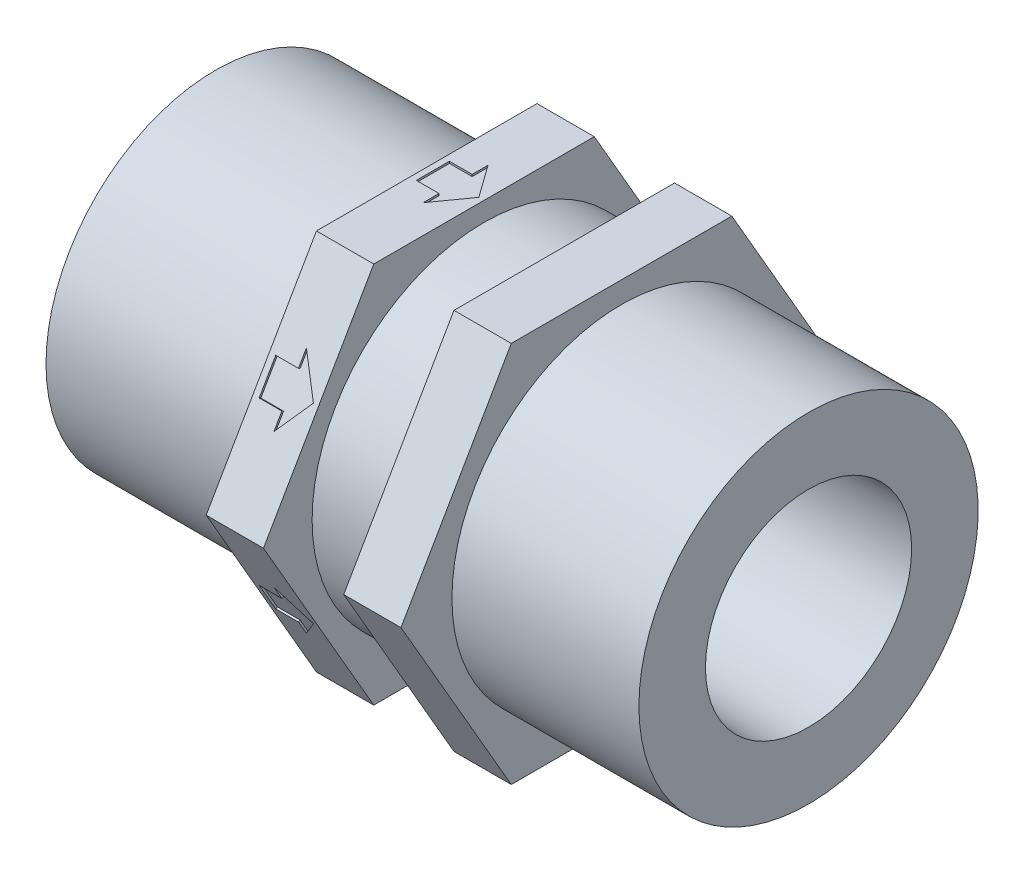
ISO-10303-21;
HEADER;
FILE_DESCRIPTION(('STEP AP214'),'2;1');
FILE_NAME('part.step','',(''),(''),'','','');
FILE_SCHEMA(('AUTOMOTIVE_DESIGN { 1 0 10303 214 1 1 1 1 }'));
ENDSEC;
DATA;
#1=APPLICATION_CONTEXT('core data for automotive mechanical design processes');
#2=APPLICATION_PROTOCOL_DEFINITION('international standard','automotive_design',2000,#1);
#3=PRODUCT_CONTEXT('',#1,'mechanical');
#4=PRODUCT('Part','Part','',(#3));
#5=PRODUCT_RELATED_PRODUCT_CATEGORY('part','',(#4));
#6=PRODUCT_DEFINITION_FORMATION('','',#4);
#7=PRODUCT_DEFINITION_CONTEXT('part definition',#1,'design');
#8=PRODUCT_DEFINITION('design','',#6,#7);
#9=PRODUCT_DEFINITION_SHAPE('','',#8);
#10=(LENGTH_UNIT() NAMED_UNIT(*) SI_UNIT(.MILLI.,.METRE.));
#11=(NAMED_UNIT(*) PLANE_ANGLE_UNIT() SI_UNIT($,.RADIAN.));
#12=(NAMED_UNIT(*) SI_UNIT($,.STERADIAN.) SOLID_ANGLE_UNIT());
#13=UNCERTAINTY_MEASURE_WITH_UNIT(LENGTH_MEASURE(1.E-05),#10,'distance_accuracy_value','');
#14=(GEOMETRIC_REPRESENTATION_CONTEXT(3) GLOBAL_UNCERTAINTY_ASSIGNED_CONTEXT((#13)) GLOBAL_UNIT_ASSIGNED_CONTEXT((#10,
#11,#12)) REPRESENTATION_CONTEXT('',''));
#15=CARTESIAN_POINT('',(0.,0.,0.));
#16=DIRECTION('',(0.,0.,1.));
#17=DIRECTION('',(1.,0.,0.));
#18=AXIS2_PLACEMENT_3D('',#15,#16,#17);
#19=CARTESIAN_POINT('',(26.924,0.,0.));
#20=DIRECTION('',(1.,0.,0.));
#21=DIRECTION('',(0.,0.,1.00000000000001));
#22=AXIS2_PLACEMENT_3D('',#19,#20,#21);
#23=PLANE('',#22);
#24=DIRECTION('',(0.,0.866025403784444,-0.500000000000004));
#25=VECTOR('',#24,1.);
#26=CARTESIAN_POINT('',(26.9240000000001,0.,14.6646968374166));
#27=LINE('',#26,#25);
#28=CARTESIAN_POINT('',(26.9240000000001,0.,14.6646968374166));
#29=VERTEX_POINT('',#28);
#30=CARTESIAN_POINT('',(26.924,12.7000000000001,7.33234841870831));
#31=VERTEX_POINT('',#30);
#32=EDGE_CURVE('E774',#29,#31,#27,.T.);
#33=ORIENTED_EDGE('',*,*,#32,.F.);
#34=DIRECTION('',(0.,0.866025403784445,0.500000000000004));
#35=VECTOR('',#34,1.);
#36=CARTESIAN_POINT('',(26.9240000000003,-12.7,7.33234841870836));
#37=LINE('',#36,#35);
#38=CARTESIAN_POINT('',(26.9240000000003,-12.7,7.33234841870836));
#39=VERTEX_POINT('',#38);
#40=EDGE_CURVE('E776',#39,#29,#37,.T.);
#41=ORIENTED_EDGE('',*,*,#40,.F.);
#42=DIRECTION('',(0.,0.,1.00000000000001));
#43=VECTOR('',#42,1.);
#44=CARTESIAN_POINT('',(26.9240000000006,-12.7,-7.33234841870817));
#45=LINE('',#44,#43);
#46=CARTESIAN_POINT('',(26.9240000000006,-12.7,-7.33234841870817));
#47=VERTEX_POINT('',#46);
#48=EDGE_CURVE('E779',#47,#39,#45,.T.);
#49=ORIENTED_EDGE('',*,*,#48,.F.);
#50=DIRECTION('',(0.,-0.866025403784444,0.500000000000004));
#51=VECTOR('',#50,1.);
#52=CARTESIAN_POINT('',(26.9240000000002,0.,-14.6646968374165));
#53=LINE('',#52,#51);
#54=CARTESIAN_POINT('',(26.9240000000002,0.,-14.6646968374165));
#55=VERTEX_POINT('',#54);
#56=EDGE_CURVE('E782',#55,#47,#53,.T.);
#57=ORIENTED_EDGE('',*,*,#56,.F.);
#58=DIRECTION('',(0.,-0.866025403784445,-0.500000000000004));
#59=VECTOR('',#58,1.);
#60=CARTESIAN_POINT('',(26.9240000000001,12.7,-7.33234841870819));
#61=LINE('',#60,#59);
#62=CARTESIAN_POINT('',(26.9240000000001,12.7,-7.33234841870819));
#63=VERTEX_POINT('',#62);
#64=EDGE_CURVE('E784',#63,#55,#61,.T.);
#65=ORIENTED_EDGE('',*,*,#64,.F.);
#66=DIRECTION('',(0.,0.,-1.00000000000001));
#67=VECTOR('',#66,1.);
#68=CARTESIAN_POINT('',(26.924,12.7000000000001,7.33234841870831));
#69=LINE('',#68,#67);
#70=EDGE_CURVE('E786',#31,#63,#69,.T.);
#71=ORIENTED_EDGE('',*,*,#70,.F.);
#72=EDGE_LOOP('',(#33,#41,#49,#57,#65,#71));
#73=FACE_BOUND('',#72,.T.);
#74=CARTESIAN_POINT('',(26.924,0.,0.));
#75=DIRECTION('',(-1.,0.,0.));
#76=DIRECTION('',(0.,0.,1.00000000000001));
#77=AXIS2_PLACEMENT_3D('',#74,#75,#76);
#78=CIRCLE('',#77,11.2785995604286);
#79=CARTESIAN_POINT('',(26.924,0.,11.2785995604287));
#80=VERTEX_POINT('',#79);
#81=EDGE_CURVE('E764',#80,#80,#78,.T.);
#82=ORIENTED_EDGE('',*,*,#81,.T.);
#83=EDGE_LOOP('',(#82));
#84=FACE_BOUND('',#83,.T.);
#85=ADVANCED_FACE('F53',(#73,#84),#23,.T.);
#86=CARTESIAN_POINT('',(13.97,0.,0.));
#87=DIRECTION('',(-1.,0.,0.));
#88=DIRECTION('',(0.,0.,1.00000000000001));
#89=AXIS2_PLACEMENT_3D('',#86,#87,#88);
#90=PLANE('',#89);
#91=DIRECTION('',(0.,-0.866025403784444,0.500000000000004));
#92=VECTOR('',#91,1.);
#93=CARTESIAN_POINT('',(13.9700000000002,0.,-14.6646968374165));
#94=LINE('',#93,#92);
#95=CARTESIAN_POINT('',(13.9700000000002,0.,-14.6646968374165));
#96=VERTEX_POINT('',#95);
#97=CARTESIAN_POINT('',(13.9700000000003,-12.7,-7.33234841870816));
#98=VERTEX_POINT('',#97);
#99=EDGE_CURVE('E828',#96,#98,#94,.T.);
#100=ORIENTED_EDGE('',*,*,#99,.T.);
#101=DIRECTION('',(0.,0.,1.00000000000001));
#102=VECTOR('',#101,1.);
#103=CARTESIAN_POINT('',(13.9700000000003,-12.7,-7.33234841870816));
#104=LINE('',#103,#102);
#105=CARTESIAN_POINT('',(13.9700000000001,-12.7,7.33234841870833));
#106=VERTEX_POINT('',#105);
#107=EDGE_CURVE('E830',#98,#106,#104,.T.);
#108=ORIENTED_EDGE('',*,*,#107,.T.);
#109=DIRECTION('',(0.,0.866025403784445,0.500000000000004));
#110=VECTOR('',#109,1.);
#111=CARTESIAN_POINT('',(13.9700000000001,-12.7,7.33234841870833));
#112=LINE('',#111,#110);
#113=CARTESIAN_POINT('',(13.9700000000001,0.,14.6646968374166));
#114=VERTEX_POINT('',#113);
#115=EDGE_CURVE('E832',#106,#114,#112,.T.);
#116=ORIENTED_EDGE('',*,*,#115,.T.);
#117=DIRECTION('',(0.,0.866025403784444,-0.500000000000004));
#118=VECTOR('',#117,1.);
#119=CARTESIAN_POINT('',(13.9700000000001,0.,14.6646968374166));
#120=LINE('',#119,#118);
#121=CARTESIAN_POINT('',(13.97,12.7000000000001,7.33234841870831));
#122=VERTEX_POINT('',#121);
#123=EDGE_CURVE('E821',#114,#122,#120,.T.);
#124=ORIENTED_EDGE('',*,*,#123,.T.);
#125=DIRECTION('',(0.,0.,-1.00000000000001));
#126=VECTOR('',#125,1.);
#127=CARTESIAN_POINT('',(13.97,12.7000000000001,7.33234841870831));
#128=LINE('',#127,#126);
#129=CARTESIAN_POINT('',(13.97,12.7,-7.33234841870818));
#130=VERTEX_POINT('',#129);
#131=EDGE_CURVE('E823',#122,#130,#128,.T.);
#132=ORIENTED_EDGE('',*,*,#131,.T.);
#133=DIRECTION('',(0.,-0.866025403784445,-0.500000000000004));
#134=VECTOR('',#133,1.);
#135=CARTESIAN_POINT('',(13.97,12.7,-7.33234841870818));
#136=LINE('',#135,#134);
#137=EDGE_CURVE('E826',#130,#96,#136,.T.);
#138=ORIENTED_EDGE('',*,*,#137,.T.);
#139=EDGE_LOOP('',(#100,#108,#116,#124,#132,#138));
#140=FACE_BOUND('',#139,.T.);
#141=CARTESIAN_POINT('',(13.97,0.,0.));
#142=DIRECTION('',(-1.,0.,0.));
#143=DIRECTION('',(0.,0.,1.00000000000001));
#144=AXIS2_PLACEMENT_3D('',#141,#142,#143);
#145=CIRCLE('',#144,11.2785995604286);
#146=CARTESIAN_POINT('',(13.97,0.,11.2785995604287));
#147=VERTEX_POINT('',#146);
#148=EDGE_CURVE('E770',#147,#147,#145,.T.);
#149=ORIENTED_EDGE('',*,*,#148,.F.);
#150=EDGE_LOOP('',(#149));
#151=FACE_BOUND('',#150,.T.);
#152=ADVANCED_FACE('F888',(#140,#151),#90,.T.);
#153=CARTESIAN_POINT('',(0.,0.,0.));
#154=DIRECTION('',(-1.,0.,0.));
#155=DIRECTION('',(0.,0.,1.00000000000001));
#156=AXIS2_PLACEMENT_3D('',#153,#154,#155);
#157=CYLINDRICAL_SURFACE('',#156,11.43);
#158=CARTESIAN_POINT('',(17.7799999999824,0.,0.));
#159=DIRECTION('',(-1.,0.,0.));
#160=DIRECTION('',(0.,0.,1.00000000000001));
#161=AXIS2_PLACEMENT_3D('',#158,#159,#160);
#162=CIRCLE('',#161,11.43);
#163=CARTESIAN_POINT('',(17.7799999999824,0.,11.4300000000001));
#164=VERTEX_POINT('',#163);
#165=EDGE_CURVE('E13',#164,#164,#162,.T.);
#166=ORIENTED_EDGE('',*,*,#165,.F.);
#167=EDGE_LOOP('',(#166));
#168=FACE_BOUND('',#167,.T.);
#169=CARTESIAN_POINT('',(23.1139999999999,0.,0.));
#170=DIRECTION('',(1.,0.,0.));
#171=DIRECTION('',(0.,1.00000000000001,0.));
#172=AXIS2_PLACEMENT_3D('',#169,#170,#171);
#173=CIRCLE('',#172,11.43);
#174=CARTESIAN_POINT('',(23.1139999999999,11.4300000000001,0.));
#175=VERTEX_POINT('',#174);
#176=EDGE_CURVE('E817',#175,#175,#173,.T.);
#177=ORIENTED_EDGE('',*,*,#176,.F.);
#178=EDGE_LOOP('',(#177));
#179=FACE_BOUND('',#178,.T.);
#180=ADVANCED_FACE('F55',(#168,#179),#157,.T.);
#181=CARTESIAN_POINT('',(17.78,0.,0.));
#182=DIRECTION('',(-1.,0.,0.));
#183=DIRECTION('',(0.,0.,1.00000000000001));
#184=AXIS2_PLACEMENT_3D('',#181,#182,#183);
#185=PLANE('',#184);
#186=DIRECTION('',(0.,0.866025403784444,-0.500000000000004));
#187=VECTOR('',#186,1.);
#188=CARTESIAN_POINT('',(17.78,0.,14.6646968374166));
#189=LINE('',#188,#187);
#190=CARTESIAN_POINT('',(17.78,0.,14.6646968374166));
#191=VERTEX_POINT('',#190);
#192=CARTESIAN_POINT('',(17.78,12.7000000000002,7.33234841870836));
#193=VERTEX_POINT('',#192);
#194=EDGE_CURVE('E820',#191,#193,#189,.T.);
#195=ORIENTED_EDGE('',*,*,#194,.F.);
#196=DIRECTION('',(0.,0.866025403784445,0.500000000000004));
#197=VECTOR('',#196,1.);
#198=CARTESIAN_POINT('',(17.7800000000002,-12.7,7.33234841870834));
#199=LINE('',#198,#197);
#200=CARTESIAN_POINT('',(17.7800000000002,-12.7,7.33234841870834));
#201=VERTEX_POINT('',#200);
#202=EDGE_CURVE('E824',#201,#191,#199,.T.);
#203=ORIENTED_EDGE('',*,*,#202,.F.);
#204=DIRECTION('',(0.,0.,1.00000000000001));
#205=VECTOR('',#204,1.);
#206=CARTESIAN_POINT('',(17.7800000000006,-12.6999999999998,-7.33234841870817));
#207=LINE('',#206,#205);
#208=CARTESIAN_POINT('',(17.7800000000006,-12.6999999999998,-7.33234841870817));
#209=VERTEX_POINT('',#208);
#210=EDGE_CURVE('E843',#209,#201,#207,.T.);
#211=ORIENTED_EDGE('',*,*,#210,.F.);
#212=DIRECTION('',(0.,-0.866025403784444,0.500000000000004));
#213=VECTOR('',#212,1.);
#214=CARTESIAN_POINT('',(17.7800000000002,0.,-14.6646968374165));
#215=LINE('',#214,#213);
#216=CARTESIAN_POINT('',(17.7800000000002,0.,-14.6646968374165));
#217=VERTEX_POINT('',#216);
#218=EDGE_CURVE('E841',#217,#209,#215,.T.);
#219=ORIENTED_EDGE('',*,*,#218,.F.);
#220=DIRECTION('',(0.,-0.866025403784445,-0.500000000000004));
#221=VECTOR('',#220,1.);
#222=CARTESIAN_POINT('',(17.78,12.7000000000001,-7.33234841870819));
#223=LINE('',#222,#221);
#224=CARTESIAN_POINT('',(17.78,12.7000000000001,-7.33234841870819));
#225=VERTEX_POINT('',#224);
#226=EDGE_CURVE('E839',#225,#217,#223,.T.);
#227=ORIENTED_EDGE('',*,*,#226,.F.);
#228=DIRECTION('',(0.,0.,-1.00000000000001));
#229=VECTOR('',#228,1.);
#230=CARTESIAN_POINT('',(17.78,12.7000000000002,7.33234841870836));
#231=LINE('',#230,#229);
#232=EDGE_CURVE('E837',#193,#225,#231,.T.);
#233=ORIENTED_EDGE('',*,*,#232,.F.);
#234=EDGE_LOOP('',(#195,#203,#211,#219,#227,#233));
#235=FACE_BOUND('',#234,.T.);
#236=ORIENTED_EDGE('',*,*,#165,.T.);
#237=EDGE_LOOP('',(#236));
#238=FACE_BOUND('',#237,.T.);
#239=ADVANCED_FACE('F873',(#235,#238),#185,.F.);
#240=CARTESIAN_POINT('',(13.9700000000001,0.,14.6646968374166));
#241=DIRECTION('',(0.,-0.500000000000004,-0.866025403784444));
#242=DIRECTION('',(0.,0.866025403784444,-0.500000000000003));
#243=AXIS2_PLACEMENT_3D('',#240,#241,#242);
#244=PLANE('',#243);
#245=DIRECTION('',(1.,0.,0.));
#246=VECTOR('',#245,1.);
#247=CARTESIAN_POINT('',(14.3783509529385,5.39590318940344,11.5493706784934));
#248=LINE('',#247,#246);
#249=CARTESIAN_POINT('',(14.3783509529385,5.39590318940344,11.5493706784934));
#250=VERTEX_POINT('',#249);
#251=CARTESIAN_POINT('',(15.8888952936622,5.39590318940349,11.5493706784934));
#252=VERTEX_POINT('',#251);
#253=EDGE_CURVE('E541',#250,#252,#248,.T.);
#254=ORIENTED_EDGE('',*,*,#253,.F.);
#255=DIRECTION('',(0.,-0.866025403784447,0.499999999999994));
#256=VECTOR('',#255,1.);
#257=CARTESIAN_POINT('',(14.3783509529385,7.30409681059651,10.4476745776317));
#258=LINE('',#257,#256);
#259=CARTESIAN_POINT('',(14.3783509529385,7.30409681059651,10.4476745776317));
#260=VERTEX_POINT('',#259);
#261=EDGE_CURVE('E69',#260,#250,#258,.T.);
#262=ORIENTED_EDGE('',*,*,#261,.F.);
#263=DIRECTION('',(-1.,0.,0.));
#264=VECTOR('',#263,1.);
#265=CARTESIAN_POINT('',(14.3783509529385,7.30409681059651,10.4476745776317));
#266=LINE('',#265,#264);
#267=CARTESIAN_POINT('',(15.8888952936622,7.30409681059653,10.4476745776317));
#268=VERTEX_POINT('',#267);
#269=EDGE_CURVE('E521',#268,#260,#266,.T.);
#270=ORIENTED_EDGE('',*,*,#269,.F.);
#271=DIRECTION('',(0.,-0.866025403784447,0.499999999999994));
#272=VECTOR('',#271,1.);
#273=CARTESIAN_POINT('',(15.8888952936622,7.30409681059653,10.4476745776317));
#274=LINE('',#273,#272);
#275=CARTESIAN_POINT('',(15.8888952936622,8.21992561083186,9.91892057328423));
#276=VERTEX_POINT('',#275);
#277=EDGE_CURVE('E554',#276,#268,#274,.T.);
#278=ORIENTED_EDGE('',*,*,#277,.F.);
#279=DIRECTION('',(-0.582249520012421,0.704087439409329,-0.406505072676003));
#280=VECTOR('',#279,1.);
#281=CARTESIAN_POINT('',(15.8888952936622,8.21992561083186,9.91892057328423));
#282=LINE('',#281,#280);
#283=CARTESIAN_POINT('',(17.4352419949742,6.34999999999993,10.9985226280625));
#284=VERTEX_POINT('',#283);
#285=EDGE_CURVE('E551',#284,#276,#282,.T.);
#286=ORIENTED_EDGE('',*,*,#285,.F.);
#287=DIRECTION('',(0.582249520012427,0.704087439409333,-0.406505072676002));
#288=VECTOR('',#287,1.);
#289=CARTESIAN_POINT('',(15.8888952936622,4.48007438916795,12.078124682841));
#290=LINE('',#289,#288);
#291=CARTESIAN_POINT('',(15.8888952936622,4.48007438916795,12.078124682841));
#292=VERTEX_POINT('',#291);
#293=EDGE_CURVE('E548',#292,#284,#290,.T.);
#294=ORIENTED_EDGE('',*,*,#293,.F.);
#295=DIRECTION('',(0.,-0.866025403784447,0.499999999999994));
#296=VECTOR('',#295,1.);
#297=CARTESIAN_POINT('',(15.8888952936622,5.39590318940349,11.5493706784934));
#298=LINE('',#297,#296);
#299=EDGE_CURVE('E545',#252,#292,#298,.T.);
#300=ORIENTED_EDGE('',*,*,#299,.F.);
#301=EDGE_LOOP('',(#254,#262,#270,#278,#286,#294,#300));
#302=FACE_BOUND('',#301,.T.);
#303=ORIENTED_EDGE('',*,*,#194,.T.);
#304=DIRECTION('',(1.,0.,0.));
#305=VECTOR('',#304,1.);
#306=CARTESIAN_POINT('',(13.97,12.7000000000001,7.33234841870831));
#307=LINE('',#306,#305);
#308=EDGE_CURVE('E62',#122,#193,#307,.T.);
#309=ORIENTED_EDGE('',*,*,#308,.F.);
#310=ORIENTED_EDGE('',*,*,#123,.F.);
#311=DIRECTION('',(1.,0.,0.));
#312=VECTOR('',#311,1.);
#313=CARTESIAN_POINT('',(13.9700000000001,0.,14.6646968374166));
#314=LINE('',#313,#312);
#315=EDGE_CURVE('E834',#114,#191,#314,.T.);
#316=ORIENTED_EDGE('',*,*,#315,.T.);
#317=EDGE_LOOP('',(#303,#309,#310,#316));
#318=FACE_BOUND('',#317,.T.);
#319=ADVANCED_FACE('F869',(#302,#318),#244,.F.);
#320=CARTESIAN_POINT('',(13.97,12.7000000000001,7.33234841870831));
#321=DIRECTION('',(0.,-1.,0.));
#322=DIRECTION('',(0.,0.,-1.00000000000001));
#323=AXIS2_PLACEMENT_3D('',#320,#321,#322);
#324=PLANE('',#323);
#325=DIRECTION('',(1.,0.,0.));
#326=VECTOR('',#325,1.);
#327=CARTESIAN_POINT('',(14.3783509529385,12.7000000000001,1.10169610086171));
#328=LINE('',#327,#326);
#329=CARTESIAN_POINT('',(14.3783509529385,12.7000000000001,1.1016961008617));
#330=VERTEX_POINT('',#329);
#331=CARTESIAN_POINT('',(15.8888952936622,12.7000000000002,1.10169610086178));
#332=VERTEX_POINT('',#331);
#333=EDGE_CURVE('E487',#330,#332,#328,.T.);
#334=ORIENTED_EDGE('',*,*,#333,.F.);
#335=DIRECTION('',(0.,0.,1.00000000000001));
#336=VECTOR('',#335,1.);
#337=CARTESIAN_POINT('',(14.3783509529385,12.7000000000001,-1.10169610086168));
#338=LINE('',#337,#336);
#339=CARTESIAN_POINT('',(14.3783509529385,12.7000000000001,-1.10169610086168));
#340=VERTEX_POINT('',#339);
#341=EDGE_CURVE('E77',#340,#330,#338,.T.);
#342=ORIENTED_EDGE('',*,*,#341,.F.);
#343=DIRECTION('',(-1.,0.,0.));
#344=VECTOR('',#343,1.);
#345=CARTESIAN_POINT('',(14.3783509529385,12.7000000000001,-1.10169610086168));
#346=LINE('',#345,#344);
#347=CARTESIAN_POINT('',(15.8888952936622,12.7000000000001,-1.10169610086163));
#348=VERTEX_POINT('',#347);
#349=EDGE_CURVE('E467',#348,#340,#346,.T.);
#350=ORIENTED_EDGE('',*,*,#349,.F.);
#351=DIRECTION('',(0.,0.,1.00000000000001));
#352=VECTOR('',#351,1.);
#353=CARTESIAN_POINT('',(15.8888952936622,12.7000000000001,-1.10169610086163));
#354=LINE('',#353,#352);
#355=CARTESIAN_POINT('',(15.8888952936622,12.7000000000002,-2.15920410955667));
#356=VERTEX_POINT('',#355);
#357=EDGE_CURVE('E500',#356,#348,#354,.T.);
#358=ORIENTED_EDGE('',*,*,#357,.F.);
#359=DIRECTION('',(-0.58224952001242,0.,-0.813010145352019));
#360=VECTOR('',#359,1.);
#361=CARTESIAN_POINT('',(15.8888952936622,12.7000000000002,-2.15920410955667));
#362=LINE('',#361,#360);
#363=CARTESIAN_POINT('',(17.4352419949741,12.7,1.11022302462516E-13));
#364=VERTEX_POINT('',#363);
#365=EDGE_CURVE('E497',#364,#356,#362,.T.);
#366=ORIENTED_EDGE('',*,*,#365,.F.);
#367=DIRECTION('',(0.582249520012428,0.,-0.813010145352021));
#368=VECTOR('',#367,1.);
#369=CARTESIAN_POINT('',(15.8888952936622,12.7,2.15920410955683));
#370=LINE('',#369,#368);
#371=CARTESIAN_POINT('',(15.8888952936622,12.7,2.15920410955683));
#372=VERTEX_POINT('',#371);
#373=EDGE_CURVE('E494',#372,#364,#370,.T.);
#374=ORIENTED_EDGE('',*,*,#373,.F.);
#375=DIRECTION('',(0.,0.,1.00000000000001));
#376=VECTOR('',#375,1.);
#377=CARTESIAN_POINT('',(15.8888952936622,12.7000000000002,1.10169610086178));
#378=LINE('',#377,#376);
#379=EDGE_CURVE('E491',#332,#372,#378,.T.);
#380=ORIENTED_EDGE('',*,*,#379,.F.);
#381=EDGE_LOOP('',(#334,#342,#350,#358,#366,#374,#380));
#382=FACE_BOUND('',#381,.T.);
#383=ORIENTED_EDGE('',*,*,#232,.T.);
#384=DIRECTION('',(1.,0.,0.));
#385=VECTOR('',#384,1.);
#386=CARTESIAN_POINT('',(13.97,12.7,-7.33234841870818));
#387=LINE('',#386,#385);
#388=EDGE_CURVE('E857',#130,#225,#387,.T.);
#389=ORIENTED_EDGE('',*,*,#388,.F.);
#390=ORIENTED_EDGE('',*,*,#131,.F.);
#391=ORIENTED_EDGE('',*,*,#308,.T.);
#392=EDGE_LOOP('',(#383,#389,#390,#391));
#393=FACE_BOUND('',#392,.T.);
#394=ADVANCED_FACE('F864',(#382,#393),#324,.F.);
#395=CARTESIAN_POINT('',(13.97,12.7,-7.33234841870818));
#396=DIRECTION('',(0.,-0.500000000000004,0.866025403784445));
#397=DIRECTION('',(0.,-0.866025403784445,-0.500000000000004));
#398=AXIS2_PLACEMENT_3D('',#395,#396,#397);
#399=PLANE('',#398);
#400=DIRECTION('',(1.,0.,0.));
#401=VECTOR('',#400,1.);
#402=CARTESIAN_POINT('',(14.3783509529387,7.30409681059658,-10.4476745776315));
#403=LINE('',#402,#401);
#404=CARTESIAN_POINT('',(14.3783509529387,7.30409681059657,-10.4476745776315));
#405=VERTEX_POINT('',#404);
#406=CARTESIAN_POINT('',(15.8888952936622,7.30409681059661,-10.4476745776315));
#407=VERTEX_POINT('',#406);
#408=EDGE_CURVE('E437',#405,#407,#403,.T.);
#409=ORIENTED_EDGE('',*,*,#408,.F.);
#410=DIRECTION('',(0.,0.866025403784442,0.500000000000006));
#411=VECTOR('',#410,1.);
#412=CARTESIAN_POINT('',(14.3783509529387,5.39590318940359,-11.5493706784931));
#413=LINE('',#412,#411);
#414=CARTESIAN_POINT('',(14.3783509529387,5.39590318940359,-11.5493706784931));
#415=VERTEX_POINT('',#414);
#416=EDGE_CURVE('E402',#415,#405,#413,.T.);
#417=ORIENTED_EDGE('',*,*,#416,.F.);
#418=DIRECTION('',(-1.,0.,0.));
#419=VECTOR('',#418,1.);
#420=CARTESIAN_POINT('',(14.3783509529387,5.39590318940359,-11.5493706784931));
#421=LINE('',#420,#419);
#422=CARTESIAN_POINT('',(15.8888952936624,5.39590318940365,-11.5493706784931));
#423=VERTEX_POINT('',#422);
#424=EDGE_CURVE('E420',#423,#415,#421,.T.);
#425=ORIENTED_EDGE('',*,*,#424,.F.);
#426=DIRECTION('',(0.,0.866025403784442,0.500000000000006));
#427=VECTOR('',#426,1.);
#428=CARTESIAN_POINT('',(15.8888952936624,5.39590318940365,-11.5493706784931));
#429=LINE('',#428,#427);
#430=CARTESIAN_POINT('',(15.8888952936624,4.48007438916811,-12.0781246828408));
#431=VERTEX_POINT('',#430);
#432=EDGE_CURVE('E423',#431,#423,#429,.T.);
#433=ORIENTED_EDGE('',*,*,#432,.F.);
#434=DIRECTION('',(-0.582249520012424,-0.704087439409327,-0.406505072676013));
#435=VECTOR('',#434,1.);
#436=CARTESIAN_POINT('',(15.8888952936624,4.48007438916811,-12.0781246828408));
#437=LINE('',#436,#435);
#438=CARTESIAN_POINT('',(17.4352419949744,6.35000000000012,-10.9985226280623));
#439=VERTEX_POINT('',#438);
#440=EDGE_CURVE('E446',#439,#431,#437,.T.);
#441=ORIENTED_EDGE('',*,*,#440,.F.);
#442=DIRECTION('',(0.582249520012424,-0.704087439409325,-0.406505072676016));
#443=VECTOR('',#442,1.);
#444=CARTESIAN_POINT('',(15.8888952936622,8.21992561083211,-9.91892057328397));
#445=LINE('',#444,#443);
#446=CARTESIAN_POINT('',(15.8888952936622,8.21992561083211,-9.91892057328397));
#447=VERTEX_POINT('',#446);
#448=EDGE_CURVE('E443',#447,#439,#445,.T.);
#449=ORIENTED_EDGE('',*,*,#448,.F.);
#450=DIRECTION('',(0.,0.866025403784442,0.500000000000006));
#451=VECTOR('',#450,1.);
#452=CARTESIAN_POINT('',(15.8888952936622,7.30409681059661,-10.4476745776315));
#453=LINE('',#452,#451);
#454=EDGE_CURVE('E440',#407,#447,#453,.T.);
#455=ORIENTED_EDGE('',*,*,#454,.F.);
#456=EDGE_LOOP('',(#409,#417,#425,#433,#441,#449,#455));
#457=FACE_BOUND('',#456,.T.);
#458=ORIENTED_EDGE('',*,*,#226,.T.);
#459=DIRECTION('',(1.,0.,0.));
#460=VECTOR('',#459,1.);
#461=CARTESIAN_POINT('',(13.9700000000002,0.,-14.6646968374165));
#462=LINE('',#461,#460);
#463=EDGE_CURVE('E854',#96,#217,#462,.T.);
#464=ORIENTED_EDGE('',*,*,#463,.F.);
#465=ORIENTED_EDGE('',*,*,#137,.F.);
#466=ORIENTED_EDGE('',*,*,#388,.T.);
#467=EDGE_LOOP('',(#458,#464,#465,#466));
#468=FACE_BOUND('',#467,.T.);
#469=ADVANCED_FACE('F880',(#457,#468),#399,.F.);
#470=CARTESIAN_POINT('',(13.9700000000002,0.,-14.6646968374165));
#471=DIRECTION('',(0.,0.500000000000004,0.866025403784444));
#472=DIRECTION('',(0.,-0.866025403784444,0.500000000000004));
#473=AXIS2_PLACEMENT_3D('',#470,#471,#472);
#474=PLANE('',#473);
#475=DIRECTION('',(1.,0.,0.));
#476=VECTOR('',#475,1.);
#477=CARTESIAN_POINT('',(14.378350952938,-5.39590318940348,-11.5493706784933));
#478=LINE('',#477,#476);
#479=CARTESIAN_POINT('',(14.378350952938,-5.39590318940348,-11.5493706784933));
#480=VERTEX_POINT('',#479);
#481=CARTESIAN_POINT('',(15.8888952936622,-5.39590318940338,-11.5493706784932));
#482=VERTEX_POINT('',#481);
#483=EDGE_CURVE('E650',#480,#482,#478,.T.);
#484=ORIENTED_EDGE('',*,*,#483,.F.);
#485=DIRECTION('',(0.,0.866025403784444,-0.500000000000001));
#486=VECTOR('',#485,1.);
#487=CARTESIAN_POINT('',(14.3783509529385,-7.30409681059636,-10.4476745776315));
#488=LINE('',#487,#486);
#489=CARTESIAN_POINT('',(14.3783509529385,-7.30409681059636,-10.4476745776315));
#490=VERTEX_POINT('',#489);
#491=EDGE_CURVE('E453',#490,#480,#488,.T.);
#492=ORIENTED_EDGE('',*,*,#491,.F.);
#493=DIRECTION('',(-1.,0.,0.));
#494=VECTOR('',#493,1.);
#495=CARTESIAN_POINT('',(14.3783509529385,-7.30409681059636,-10.4476745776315));
#496=LINE('',#495,#494);
#497=CARTESIAN_POINT('',(15.8888952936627,-7.30409681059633,-10.4476745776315));
#498=VERTEX_POINT('',#497);
#499=EDGE_CURVE('E630',#498,#490,#496,.T.);
#500=ORIENTED_EDGE('',*,*,#499,.F.);
#501=DIRECTION('',(0.,0.866025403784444,-0.500000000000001));
#502=VECTOR('',#501,1.);
#503=CARTESIAN_POINT('',(15.8888952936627,-7.30409681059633,-10.4476745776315));
#504=LINE('',#503,#502);
#505=CARTESIAN_POINT('',(15.8888952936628,-8.21992561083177,-9.918920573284));
#506=VERTEX_POINT('',#505);
#507=EDGE_CURVE('E662',#506,#498,#504,.T.);
#508=ORIENTED_EDGE('',*,*,#507,.F.);
#509=DIRECTION('',(-0.582249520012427,-0.70408743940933,0.406505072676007));
#510=VECTOR('',#509,1.);
#511=CARTESIAN_POINT('',(15.8888952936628,-8.21992561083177,-9.918920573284));
#512=LINE('',#511,#510);
#513=CARTESIAN_POINT('',(17.4352419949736,-6.34999999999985,-10.9985226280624));
#514=VERTEX_POINT('',#513);
#515=EDGE_CURVE('E659',#514,#506,#512,.T.);
#516=ORIENTED_EDGE('',*,*,#515,.F.);
#517=DIRECTION('',(0.582249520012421,-0.704087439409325,0.406505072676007));
#518=VECTOR('',#517,1.);
#519=CARTESIAN_POINT('',(15.8888952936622,-4.480074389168,-12.0781246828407));
#520=LINE('',#519,#518);
#521=CARTESIAN_POINT('',(15.8888952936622,-4.480074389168,-12.0781246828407));
#522=VERTEX_POINT('',#521);
#523=EDGE_CURVE('E656',#522,#514,#520,.T.);
#524=ORIENTED_EDGE('',*,*,#523,.F.);
#525=DIRECTION('',(0.,0.866025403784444,-0.500000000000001));
#526=VECTOR('',#525,1.);
#527=CARTESIAN_POINT('',(15.8888952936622,-5.39590318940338,-11.5493706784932));
#528=LINE('',#527,#526);
#529=EDGE_CURVE('E653',#482,#522,#528,.T.);
#530=ORIENTED_EDGE('',*,*,#529,.F.);
#531=EDGE_LOOP('',(#484,#492,#500,#508,#516,#524,#530));
#532=FACE_BOUND('',#531,.T.);
#533=ORIENTED_EDGE('',*,*,#218,.T.);
#534=DIRECTION('',(1.,0.,0.));
#535=VECTOR('',#534,1.);
#536=CARTESIAN_POINT('',(13.9700000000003,-12.7,-7.33234841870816));
#537=LINE('',#536,#535);
#538=EDGE_CURVE('E851',#98,#209,#537,.T.);
#539=ORIENTED_EDGE('',*,*,#538,.F.);
#540=ORIENTED_EDGE('',*,*,#99,.F.);
#541=ORIENTED_EDGE('',*,*,#463,.T.);
#542=EDGE_LOOP('',(#533,#539,#540,#541));
#543=FACE_BOUND('',#542,.T.);
#544=ADVANCED_FACE('F884',(#532,#543),#474,.F.);
#545=CARTESIAN_POINT('',(13.9700000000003,-12.7,-7.33234841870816));
#546=DIRECTION('',(0.,1.00000000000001,0.));
#547=DIRECTION('',(-1.,0.,0.));
#548=AXIS2_PLACEMENT_3D('',#545,#546,#547);
#549=PLANE('',#548);
#550=DIRECTION('',(1.,0.,0.));
#551=VECTOR('',#550,1.);
#552=CARTESIAN_POINT('',(14.3783509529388,-12.7,-1.10169610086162));
#553=LINE('',#552,#551);
#554=CARTESIAN_POINT('',(14.3783509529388,-12.7,-1.10169610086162));
#555=VERTEX_POINT('',#554);
#556=CARTESIAN_POINT('',(15.8888952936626,-12.6999999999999,-1.10169610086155));
#557=VERTEX_POINT('',#556);
#558=EDGE_CURVE('E706',#555,#557,#553,.T.);
#559=ORIENTED_EDGE('',*,*,#558,.F.);
#560=DIRECTION('',(0.,0.,-1.00000000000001));
#561=VECTOR('',#560,1.);
#562=CARTESIAN_POINT('',(14.3783509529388,-12.6999999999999,1.10169610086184));
#563=LINE('',#562,#561);
#564=CARTESIAN_POINT('',(14.3783509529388,-12.6999999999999,1.10169610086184));
#565=VERTEX_POINT('',#564);
#566=EDGE_CURVE('E669',#565,#555,#563,.T.);
#567=ORIENTED_EDGE('',*,*,#566,.F.);
#568=DIRECTION('',(-1.,0.,0.));
#569=VECTOR('',#568,1.);
#570=CARTESIAN_POINT('',(14.3783509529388,-12.6999999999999,1.10169610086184));
#571=LINE('',#570,#569);
#572=CARTESIAN_POINT('',(15.8888952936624,-12.6999999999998,1.10169610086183));
#573=VERTEX_POINT('',#572);
#574=EDGE_CURVE('E686',#573,#565,#571,.T.);
#575=ORIENTED_EDGE('',*,*,#574,.F.);
#576=DIRECTION('',(0.,0.,-1.00000000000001));
#577=VECTOR('',#576,1.);
#578=CARTESIAN_POINT('',(15.8888952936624,-12.6999999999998,1.10169610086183));
#579=LINE('',#578,#577);
#580=CARTESIAN_POINT('',(15.8888952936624,-12.6999999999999,2.15920410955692));
#581=VERTEX_POINT('',#580);
#582=EDGE_CURVE('E718',#581,#573,#579,.T.);
#583=ORIENTED_EDGE('',*,*,#582,.F.);
#584=DIRECTION('',(-0.582249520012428,0.,0.81301014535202));
#585=VECTOR('',#584,1.);
#586=CARTESIAN_POINT('',(15.8888952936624,-12.6999999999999,2.15920410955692));
#587=LINE('',#586,#585);
#588=CARTESIAN_POINT('',(17.4352419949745,-12.6999999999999,0.));
#589=VERTEX_POINT('',#588);
#590=EDGE_CURVE('E715',#589,#581,#587,.T.);
#591=ORIENTED_EDGE('',*,*,#590,.F.);
#592=DIRECTION('',(0.58224952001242,0.,0.813010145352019));
#593=VECTOR('',#592,1.);
#594=CARTESIAN_POINT('',(15.8888952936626,-12.7,-2.15920410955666));
#595=LINE('',#594,#593);
#596=CARTESIAN_POINT('',(15.8888952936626,-12.7,-2.15920410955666));
#597=VERTEX_POINT('',#596);
#598=EDGE_CURVE('E712',#597,#589,#595,.T.);
#599=ORIENTED_EDGE('',*,*,#598,.F.);
#600=DIRECTION('',(0.,0.,-1.00000000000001));
#601=VECTOR('',#600,1.);
#602=CARTESIAN_POINT('',(15.8888952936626,-12.6999999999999,-1.10169610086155));
#603=LINE('',#602,#601);
#604=EDGE_CURVE('E709',#557,#597,#603,.T.);
#605=ORIENTED_EDGE('',*,*,#604,.F.);
#606=EDGE_LOOP('',(#559,#567,#575,#583,#591,#599,#605));
#607=FACE_BOUND('',#606,.T.);
#608=ORIENTED_EDGE('',*,*,#210,.T.);
#609=DIRECTION('',(1.,0.,0.));
#610=VECTOR('',#609,1.);
#611=CARTESIAN_POINT('',(13.9700000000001,-12.7,7.33234841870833));
#612=LINE('',#611,#610);
#613=EDGE_CURVE('E848',#106,#201,#612,.T.);
#614=ORIENTED_EDGE('',*,*,#613,.F.);
#615=ORIENTED_EDGE('',*,*,#107,.F.);
#616=ORIENTED_EDGE('',*,*,#538,.T.);
#617=EDGE_LOOP('',(#608,#614,#615,#616));
#618=FACE_BOUND('',#617,.T.);
#619=ADVANCED_FACE('F895',(#607,#618),#549,.F.);
#620=CARTESIAN_POINT('',(13.9700000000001,-12.7,7.33234841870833));
#621=DIRECTION('',(0.,0.500000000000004,-0.866025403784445));
#622=DIRECTION('',(0.,0.866025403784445,0.500000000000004));
#623=AXIS2_PLACEMENT_3D('',#620,#621,#622);
#624=PLANE('',#623);
#625=DIRECTION('',(1.,0.,0.));
#626=VECTOR('',#625,1.);
#627=CARTESIAN_POINT('',(14.3783509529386,-7.30409681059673,10.4476745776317));
#628=LINE('',#627,#626);
#629=CARTESIAN_POINT('',(14.3783509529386,-7.30409681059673,10.4476745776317));
#630=VERTEX_POINT('',#629);
#631=CARTESIAN_POINT('',(15.8888952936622,-7.30409681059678,10.4476745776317));
#632=VERTEX_POINT('',#631);
#633=EDGE_CURVE('E596',#630,#632,#628,.T.);
#634=ORIENTED_EDGE('',*,*,#633,.F.);
#635=DIRECTION('',(0.,-0.866025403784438,-0.500000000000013));
#636=VECTOR('',#635,1.);
#637=CARTESIAN_POINT('',(14.378350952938,-5.39590318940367,11.5493706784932));
#638=LINE('',#637,#636);
#639=CARTESIAN_POINT('',(14.378350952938,-5.39590318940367,11.5493706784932));
#640=VERTEX_POINT('',#639);
#641=EDGE_CURVE('E594',#640,#630,#638,.T.);
#642=ORIENTED_EDGE('',*,*,#641,.F.);
#643=DIRECTION('',(-1.,0.,0.));
#644=VECTOR('',#643,1.);
#645=CARTESIAN_POINT('',(14.378350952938,-5.39590318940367,11.5493706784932));
#646=LINE('',#645,#644);
#647=CARTESIAN_POINT('',(15.8888952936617,-5.39590318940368,11.5493706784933));
#648=VERTEX_POINT('',#647);
#649=EDGE_CURVE('E575',#648,#640,#646,.T.);
#650=ORIENTED_EDGE('',*,*,#649,.F.);
#651=DIRECTION('',(0.,-0.866025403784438,-0.500000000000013));
#652=VECTOR('',#651,1.);
#653=CARTESIAN_POINT('',(15.8888952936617,-5.39590318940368,11.5493706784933));
#654=LINE('',#653,#652);
#655=CARTESIAN_POINT('',(15.8888952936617,-4.48007438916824,12.0781246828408));
#656=VERTEX_POINT('',#655);
#657=EDGE_CURVE('E608',#656,#648,#654,.T.);
#658=ORIENTED_EDGE('',*,*,#657,.F.);
#659=DIRECTION('',(-0.582249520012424,0.704087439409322,0.40650507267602));
#660=VECTOR('',#659,1.);
#661=CARTESIAN_POINT('',(15.8888952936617,-4.48007438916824,12.0781246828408));
#662=LINE('',#661,#660);
#663=CARTESIAN_POINT('',(17.4352419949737,-6.35000000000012,10.9985226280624));
#664=VERTEX_POINT('',#663);
#665=EDGE_CURVE('E605',#664,#656,#662,.T.);
#666=ORIENTED_EDGE('',*,*,#665,.F.);
#667=DIRECTION('',(0.582249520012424,0.704087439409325,0.406505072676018));
#668=VECTOR('',#667,1.);
#669=CARTESIAN_POINT('',(15.8888952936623,-8.21992561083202,9.91892057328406));
#670=LINE('',#669,#668);
#671=CARTESIAN_POINT('',(15.8888952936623,-8.21992561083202,9.91892057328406));
#672=VERTEX_POINT('',#671);
#673=EDGE_CURVE('E602',#672,#664,#670,.T.);
#674=ORIENTED_EDGE('',*,*,#673,.F.);
#675=DIRECTION('',(0.,-0.866025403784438,-0.500000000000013));
#676=VECTOR('',#675,1.);
#677=CARTESIAN_POINT('',(15.8888952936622,-7.30409681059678,10.4476745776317));
#678=LINE('',#677,#676);
#679=EDGE_CURVE('E599',#632,#672,#678,.T.);
#680=ORIENTED_EDGE('',*,*,#679,.F.);
#681=EDGE_LOOP('',(#634,#642,#650,#658,#666,#674,#680));
#682=FACE_BOUND('',#681,.T.);
#683=ORIENTED_EDGE('',*,*,#202,.T.);
#684=ORIENTED_EDGE('',*,*,#315,.F.);
#685=ORIENTED_EDGE('',*,*,#115,.F.);
#686=ORIENTED_EDGE('',*,*,#613,.T.);
#687=EDGE_LOOP('',(#683,#684,#685,#686));
#688=FACE_BOUND('',#687,.T.);
#689=ADVANCED_FACE('F893',(#682,#688),#624,.F.);
#690=CARTESIAN_POINT('',(23.1139999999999,0.,0.));
#691=DIRECTION('',(1.,0.,0.));
#692=DIRECTION('',(0.,0.,1.00000000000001));
#693=AXIS2_PLACEMENT_3D('',#690,#691,#692);
#694=PLANE('',#693);
#695=DIRECTION('',(0.,0.866025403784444,-0.500000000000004));
#696=VECTOR('',#695,1.);
#697=CARTESIAN_POINT('',(23.114,1.07552855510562E-13,14.6646968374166));
#698=LINE('',#697,#696);
#699=CARTESIAN_POINT('',(23.114,1.07552855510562E-13,14.6646968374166));
#700=VERTEX_POINT('',#699);
#701=CARTESIAN_POINT('',(23.114,12.7000000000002,7.33234841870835));
#702=VERTEX_POINT('',#701);
#703=EDGE_CURVE('E773',#700,#702,#698,.T.);
#704=ORIENTED_EDGE('',*,*,#703,.T.);
#705=DIRECTION('',(0.,0.,-1.00000000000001));
#706=VECTOR('',#705,1.);
#707=CARTESIAN_POINT('',(23.114,12.7000000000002,7.33234841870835));
#708=LINE('',#707,#706);
#709=CARTESIAN_POINT('',(23.1140000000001,12.7000000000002,-7.33234841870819));
#710=VERTEX_POINT('',#709);
#711=EDGE_CURVE('E777',#702,#710,#708,.T.);
#712=ORIENTED_EDGE('',*,*,#711,.T.);
#713=DIRECTION('',(0.,-0.866025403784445,-0.500000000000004));
#714=VECTOR('',#713,1.);
#715=CARTESIAN_POINT('',(23.1140000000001,12.7000000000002,-7.33234841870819));
#716=LINE('',#715,#714);
#717=CARTESIAN_POINT('',(23.1140000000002,1.14491749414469E-13,-14.6646968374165));
#718=VERTEX_POINT('',#717);
#719=EDGE_CURVE('E801',#710,#718,#716,.T.);
#720=ORIENTED_EDGE('',*,*,#719,.T.);
#721=DIRECTION('',(0.,-0.866025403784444,0.500000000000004));
#722=VECTOR('',#721,1.);
#723=CARTESIAN_POINT('',(23.1140000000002,1.14491749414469E-13,-14.6646968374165));
#724=LINE('',#723,#722);
#725=CARTESIAN_POINT('',(23.1140000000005,-12.7,-7.33234841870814));
#726=VERTEX_POINT('',#725);
#727=EDGE_CURVE('E798',#718,#726,#724,.T.);
#728=ORIENTED_EDGE('',*,*,#727,.T.);
#729=DIRECTION('',(0.,0.,1.00000000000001));
#730=VECTOR('',#729,1.);
#731=CARTESIAN_POINT('',(23.1140000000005,-12.7,-7.33234841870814));
#732=LINE('',#731,#730);
#733=CARTESIAN_POINT('',(23.1140000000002,-12.6999999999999,7.33234841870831));
#734=VERTEX_POINT('',#733);
#735=EDGE_CURVE('E795',#726,#734,#732,.T.);
#736=ORIENTED_EDGE('',*,*,#735,.T.);
#737=DIRECTION('',(0.,0.866025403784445,0.500000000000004));
#738=VECTOR('',#737,1.);
#739=CARTESIAN_POINT('',(23.1140000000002,-12.6999999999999,7.33234841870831));
#740=LINE('',#739,#738);
#741=EDGE_CURVE('E792',#734,#700,#740,.T.);
#742=ORIENTED_EDGE('',*,*,#741,.T.);
#743=EDGE_LOOP('',(#704,#712,#720,#728,#736,#742));
#744=FACE_BOUND('',#743,.T.);
#745=ORIENTED_EDGE('',*,*,#176,.T.);
#746=EDGE_LOOP('',(#745));
#747=FACE_BOUND('',#746,.T.);
#748=ADVANCED_FACE('F903',(#744,#747),#694,.F.);
#749=CARTESIAN_POINT('',(26.9240000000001,0.,14.6646968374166));
#750=DIRECTION('',(0.,0.500000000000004,0.866025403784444));
#751=DIRECTION('',(0.,-0.866025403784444,0.500000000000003));
#752=AXIS2_PLACEMENT_3D('',#749,#750,#751);
#753=PLANE('',#752);
#754=ORIENTED_EDGE('',*,*,#703,.F.);
#755=DIRECTION('',(-1.,0.,0.));
#756=VECTOR('',#755,1.);
#757=CARTESIAN_POINT('',(26.9240000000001,0.,14.6646968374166));
#758=LINE('',#757,#756);
#759=EDGE_CURVE('E815',#29,#700,#758,.T.);
#760=ORIENTED_EDGE('',*,*,#759,.F.);
#761=ORIENTED_EDGE('',*,*,#32,.T.);
#762=DIRECTION('',(-1.,0.,0.));
#763=VECTOR('',#762,1.);
#764=CARTESIAN_POINT('',(26.924,12.7000000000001,7.33234841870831));
#765=LINE('',#764,#763);
#766=EDGE_CURVE('E789',#31,#702,#765,.T.);
#767=ORIENTED_EDGE('',*,*,#766,.T.);
#768=EDGE_LOOP('',(#754,#760,#761,#767));
#769=FACE_BOUND('',#768,.T.);
#770=ADVANCED_FACE('F924',(#769),#753,.T.);
#771=CARTESIAN_POINT('',(26.9240000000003,-12.7,7.33234841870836));
#772=DIRECTION('',(0.,-0.500000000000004,0.866025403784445));
#773=DIRECTION('',(0.,-0.866025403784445,-0.500000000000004));
#774=AXIS2_PLACEMENT_3D('',#771,#772,#773);
#775=PLANE('',#774);
#776=ORIENTED_EDGE('',*,*,#741,.F.);
#777=DIRECTION('',(-1.,0.,0.));
#778=VECTOR('',#777,1.);
#779=CARTESIAN_POINT('',(26.9240000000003,-12.7,7.33234841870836));
#780=LINE('',#779,#778);
#781=EDGE_CURVE('E813',#39,#734,#780,.T.);
#782=ORIENTED_EDGE('',*,*,#781,.F.);
#783=ORIENTED_EDGE('',*,*,#40,.T.);
#784=ORIENTED_EDGE('',*,*,#759,.T.);
#785=EDGE_LOOP('',(#776,#782,#783,#784));
#786=FACE_BOUND('',#785,.T.);
#787=ADVANCED_FACE('F941',(#786),#775,.T.);
#788=CARTESIAN_POINT('',(26.9240000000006,-12.7,-7.33234841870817));
#789=DIRECTION('',(0.,-1.00000000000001,0.));
#790=DIRECTION('',(1.,0.,0.));
#791=AXIS2_PLACEMENT_3D('',#788,#789,#790);
#792=PLANE('',#791);
#793=ORIENTED_EDGE('',*,*,#735,.F.);
#794=DIRECTION('',(-1.,0.,0.));
#795=VECTOR('',#794,1.);
#796=CARTESIAN_POINT('',(26.9240000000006,-12.7,-7.33234841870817));
#797=LINE('',#796,#795);
#798=EDGE_CURVE('E811',#47,#726,#797,.T.);
#799=ORIENTED_EDGE('',*,*,#798,.F.);
#800=ORIENTED_EDGE('',*,*,#48,.T.);
#801=ORIENTED_EDGE('',*,*,#781,.T.);
#802=EDGE_LOOP('',(#793,#799,#800,#801));
#803=FACE_BOUND('',#802,.T.);
#804=ADVANCED_FACE('F937',(#803),#792,.T.);
#805=CARTESIAN_POINT('',(26.9240000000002,0.,-14.6646968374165));
#806=DIRECTION('',(0.,-0.500000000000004,-0.866025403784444));
#807=DIRECTION('',(0.,0.866025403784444,-0.500000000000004));
#808=AXIS2_PLACEMENT_3D('',#805,#806,#807);
#809=PLANE('',#808);
#810=ORIENTED_EDGE('',*,*,#727,.F.);
#811=DIRECTION('',(-1.,0.,0.));
#812=VECTOR('',#811,1.);
#813=CARTESIAN_POINT('',(26.9240000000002,0.,-14.6646968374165));
#814=LINE('',#813,#812);
#815=EDGE_CURVE('E809',#55,#718,#814,.T.);
#816=ORIENTED_EDGE('',*,*,#815,.F.);
#817=ORIENTED_EDGE('',*,*,#56,.T.);
#818=ORIENTED_EDGE('',*,*,#798,.T.);
#819=EDGE_LOOP('',(#810,#816,#817,#818));
#820=FACE_BOUND('',#819,.T.);
#821=ADVANCED_FACE('F933',(#820),#809,.T.);
#822=CARTESIAN_POINT('',(26.9240000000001,12.7,-7.33234841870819));
#823=DIRECTION('',(0.,0.500000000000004,-0.866025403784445));
#824=DIRECTION('',(0.,0.866025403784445,0.500000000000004));
#825=AXIS2_PLACEMENT_3D('',#822,#823,#824);
#826=PLANE('',#825);
#827=ORIENTED_EDGE('',*,*,#719,.F.);
#828=DIRECTION('',(-1.,0.,0.));
#829=VECTOR('',#828,1.);
#830=CARTESIAN_POINT('',(26.9240000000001,12.7,-7.33234841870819));
#831=LINE('',#830,#829);
#832=EDGE_CURVE('E807',#63,#710,#831,.T.);
#833=ORIENTED_EDGE('',*,*,#832,.F.);
#834=ORIENTED_EDGE('',*,*,#64,.T.);
#835=ORIENTED_EDGE('',*,*,#815,.T.);
#836=EDGE_LOOP('',(#827,#833,#834,#835));
#837=FACE_BOUND('',#836,.T.);
#838=ADVANCED_FACE('F929',(#837),#826,.T.);
#839=CARTESIAN_POINT('',(26.924,12.7000000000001,7.33234841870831));
#840=DIRECTION('',(0.,1.,0.));
#841=DIRECTION('',(0.,0.,1.00000000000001));
#842=AXIS2_PLACEMENT_3D('',#839,#840,#841);
#843=PLANE('',#842);
#844=ORIENTED_EDGE('',*,*,#711,.F.);
#845=ORIENTED_EDGE('',*,*,#766,.F.);
#846=ORIENTED_EDGE('',*,*,#70,.T.);
#847=ORIENTED_EDGE('',*,*,#832,.T.);
#848=EDGE_LOOP('',(#844,#845,#846,#847));
#849=FACE_BOUND('',#848,.T.);
#850=ADVANCED_FACE('F926',(#849),#843,.T.);
#851=CARTESIAN_POINT('',(0.,0.,0.));
#852=DIRECTION('',(-1.,0.,0.));
#853=DIRECTION('',(0.,0.,1.00000000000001));
#854=AXIS2_PLACEMENT_3D('',#851,#852,#853);
#855=CYLINDRICAL_SURFACE('',#854,11.2785995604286);
#856=CARTESIAN_POINT('',(-0.0660422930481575,0.,0.));
#857=DIRECTION('',(-1.,0.,0.));
#858=DIRECTION('',(0.,0.,1.00000000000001));
#859=AXIS2_PLACEMENT_3D('',#856,#857,#858);
#860=CIRCLE('',#859,11.2785995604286);
#861=CARTESIAN_POINT('',(-0.0660422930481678,0.,11.2785995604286));
#862=VERTEX_POINT('',#861);
#863=EDGE_CURVE('E767',#862,#862,#860,.T.);
#864=ORIENTED_EDGE('',*,*,#863,.F.);
#865=EDGE_LOOP('',(#864));
#866=FACE_BOUND('',#865,.T.);
#867=ORIENTED_EDGE('',*,*,#148,.T.);
#868=EDGE_LOOP('',(#867));
#869=FACE_BOUND('',#868,.T.);
#870=ADVANCED_FACE('F920',(#866,#869),#855,.T.);
#871=CARTESIAN_POINT('',(-0.0660422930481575,11.2785995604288,0.));
#872=DIRECTION('',(1.,0.,0.));
#873=DIRECTION('',(0.,0.,-1.00000000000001));
#874=AXIS2_PLACEMENT_3D('',#871,#872,#873);
#875=PLANE('',#874);
#876=CARTESIAN_POINT('',(-0.0660422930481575,0.,0.));
#877=DIRECTION('',(-1.,0.,0.));
#878=DIRECTION('',(0.,0.,1.00000000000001));
#879=AXIS2_PLACEMENT_3D('',#876,#877,#878);
#880=CIRCLE('',#879,6.8545837);
#881=CARTESIAN_POINT('',(-0.0660422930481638,0.,6.85458370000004));
#882=VERTEX_POINT('',#881);
#883=EDGE_CURVE('E749',#882,#882,#880,.T.);
#884=ORIENTED_EDGE('',*,*,#883,.F.);
#885=EDGE_LOOP('',(#884));
#886=FACE_BOUND('',#885,.T.);
#887=ORIENTED_EDGE('',*,*,#863,.T.);
#888=EDGE_LOOP('',(#887));
#889=FACE_BOUND('',#888,.T.);
#890=ADVANCED_FACE('F982',(#886,#889),#875,.F.);
#891=CARTESIAN_POINT('',(0.,0.,0.));
#892=DIRECTION('',(-1.,0.,0.));
#893=DIRECTION('',(0.,0.,1.00000000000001));
#894=AXIS2_PLACEMENT_3D('',#891,#892,#893);
#895=CYLINDRICAL_SURFACE('',#894,11.2785995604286);
#896=ORIENTED_EDGE('',*,*,#81,.F.);
#897=EDGE_LOOP('',(#896));
#898=FACE_BOUND('',#897,.T.);
#899=CARTESIAN_POINT('',(39.3572648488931,1.17961196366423E-13,0.));
#900=DIRECTION('',(-1.,0.,0.));
#901=DIRECTION('',(0.,0.,1.00000000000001));
#902=AXIS2_PLACEMENT_3D('',#899,#900,#901);
#903=CIRCLE('',#902,11.2785995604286);
#904=CARTESIAN_POINT('',(39.3572648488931,1.17961196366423E-13,11.2785995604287));
#905=VERTEX_POINT('',#904);
#906=EDGE_CURVE('E761',#905,#905,#903,.T.);
#907=ORIENTED_EDGE('',*,*,#906,.T.);
#908=EDGE_LOOP('',(#907));
#909=FACE_BOUND('',#908,.T.);
#910=ADVANCED_FACE('F989',(#898,#909),#895,.T.);
#911=CARTESIAN_POINT('',(39.3572648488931,11.2785995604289,0.));
#912=DIRECTION('',(-1.,0.,0.));
#913=DIRECTION('',(0.,0.,1.00000000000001));
#914=AXIS2_PLACEMENT_3D('',#911,#912,#913);
#915=PLANE('',#914);
#916=CARTESIAN_POINT('',(39.3572648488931,1.17961196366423E-13,0.));
#917=DIRECTION('',(1.,0.,0.));
#918=DIRECTION('',(0.,0.,-1.00000000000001));
#919=AXIS2_PLACEMENT_3D('',#916,#917,#918);
#920=CIRCLE('',#919,6.8545837);
#921=CARTESIAN_POINT('',(39.3572648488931,1.17961196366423E-13,-6.8545837));
#922=VERTEX_POINT('',#921);
#923=EDGE_CURVE('E725',#922,#922,#920,.T.);
#924=ORIENTED_EDGE('',*,*,#923,.F.);
#925=EDGE_LOOP('',(#924));
#926=FACE_BOUND('',#925,.T.);
#927=ORIENTED_EDGE('',*,*,#906,.F.);
#928=EDGE_LOOP('',(#927));
#929=FACE_BOUND('',#928,.T.);
#930=ADVANCED_FACE('F996',(#926,#929),#915,.F.);
#931=CARTESIAN_POINT('',(16.9519577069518,0.,0.));
#932=DIRECTION('',(-1.,0.,0.));
#933=DIRECTION('',(0.,0.,1.00000000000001));
#934=AXIS2_PLACEMENT_3D('',#931,#932,#933);
#935=CONICAL_SURFACE('',#934,5.5626,1.02974425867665);
#936=CARTESIAN_POINT('',(19.6456112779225,0.,1.14491749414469E-13));
#937=DIRECTION('',(1.,0.,0.));
#938=DIRECTION('',(0.,0.,-1.00000000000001));
#939=AXIS2_PLACEMENT_3D('',#936,#937,#938);
#940=CIRCLE('',#939,1.07960762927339);
#941=CARTESIAN_POINT('',(19.6456112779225,0.,1.07960762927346));
#942=VERTEX_POINT('',#941);
#943=EDGE_CURVE('E57',#942,#942,#940,.T.);
#944=CARTESIAN_POINT('',(16.9519577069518,0.,0.));
#945=DIRECTION('',(-1.,0.,0.));
#946=DIRECTION('',(0.,0.,1.00000000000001));
#947=AXIS2_PLACEMENT_3D('',#944,#945,#946);
#948=CIRCLE('',#947,5.5626);
#949=CARTESIAN_POINT('',(16.9519577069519,0.,5.56260000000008));
#950=VERTEX_POINT('',#949);
#951=EDGE_CURVE('E758',#950,#950,#948,.T.);
#952=CARTESIAN_POINT('',(19.6456112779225,0.,1.07960762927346));
#953=CARTESIAN_POINT('',(19.6175523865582,0.,1.12630546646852));
#954=CARTESIAN_POINT('',(19.5894934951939,0.,1.17300330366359));
#955=CARTESIAN_POINT('',(19.5333757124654,0.,1.26639897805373));
#956=CARTESIAN_POINT('',(19.5053168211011,0.,1.3130968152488));
#957=CARTESIAN_POINT('',(19.4491990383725,0.,1.40649248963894));
#958=CARTESIAN_POINT('',(19.4211401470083,0.,1.45319032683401));
#959=CARTESIAN_POINT('',(19.3650223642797,0.,1.54658600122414));
#960=CARTESIAN_POINT('',(19.3369634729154,0.,1.59328383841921));
#961=CARTESIAN_POINT('',(19.2808456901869,0.,1.68667951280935));
#962=CARTESIAN_POINT('',(19.2527867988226,0.,1.73337735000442));
#963=CARTESIAN_POINT('',(19.196669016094,0.,1.82677302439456));
#964=CARTESIAN_POINT('',(19.1686101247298,0.,1.87347086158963));
#965=CARTESIAN_POINT('',(19.1124923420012,0.,1.96686653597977));
#966=CARTESIAN_POINT('',(19.0844334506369,0.,2.01356437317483));
#967=CARTESIAN_POINT('',(19.0283156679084,0.,2.10696004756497));
#968=CARTESIAN_POINT('',(19.0002567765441,0.,2.15365788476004));
#969=CARTESIAN_POINT('',(18.9441389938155,0.,2.24705355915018));
#970=CARTESIAN_POINT('',(18.9160801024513,0.,2.29375139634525));
#971=CARTESIAN_POINT('',(18.8599623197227,0.,2.38714707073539));
#972=CARTESIAN_POINT('',(18.8319034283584,0.,2.43384490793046));
#973=CARTESIAN_POINT('',(18.7757856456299,0.,2.52724058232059));
#974=CARTESIAN_POINT('',(18.7477267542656,0.,2.57393841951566));
#975=CARTESIAN_POINT('',(18.691608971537,0.,2.6673340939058));
#976=CARTESIAN_POINT('',(18.6635500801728,0.,2.71403193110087));
#977=CARTESIAN_POINT('',(18.6074322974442,0.,2.80742760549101));
#978=CARTESIAN_POINT('',(18.5793734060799,0.,2.85412544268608));
#979=CARTESIAN_POINT('',(18.5232556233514,0.,2.94752111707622));
#980=CARTESIAN_POINT('',(18.4951967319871,0.,2.99421895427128));
#981=CARTESIAN_POINT('',(18.4390789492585,0.,3.08761462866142));
#982=CARTESIAN_POINT('',(18.4110200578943,0.,3.13431246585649));
#983=CARTESIAN_POINT('',(18.3549022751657,0.,3.22770814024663));
#984=CARTESIAN_POINT('',(18.3268433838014,0.,3.2744059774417));
#985=CARTESIAN_POINT('',(18.2707256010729,0.,3.36780165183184));
#986=CARTESIAN_POINT('',(18.2426667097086,0.,3.4144994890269));
#987=CARTESIAN_POINT('',(18.1865489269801,0.,3.50789516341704));
#988=CARTESIAN_POINT('',(18.1584900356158,0.,3.55459300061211));
#989=CARTESIAN_POINT('',(18.1023722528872,0.,3.64798867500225));
#990=CARTESIAN_POINT('',(18.0743133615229,0.,3.69468651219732));
#991=CARTESIAN_POINT('',(18.0181955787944,0.,3.78808218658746));
#992=CARTESIAN_POINT('',(17.9901366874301,0.,3.83478002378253));
#993=CARTESIAN_POINT('',(17.9340189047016,0.,3.92817569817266));
#994=CARTESIAN_POINT('',(17.9059600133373,0.,3.97487353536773));
#995=CARTESIAN_POINT('',(17.8498422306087,0.,4.06826920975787));
#996=CARTESIAN_POINT('',(17.8217833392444,0.,4.11496704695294));
#997=CARTESIAN_POINT('',(17.7656655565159,0.,4.20836272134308));
#998=CARTESIAN_POINT('',(17.7376066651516,0.,4.25506055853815));
#999=CARTESIAN_POINT('',(17.6814888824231,0.,4.34845623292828));
#1000=CARTESIAN_POINT('',(17.6534299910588,0.,4.39515407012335));
#1001=CARTESIAN_POINT('',(17.5973122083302,0.,4.48854974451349));
#1002=CARTESIAN_POINT('',(17.569253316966,0.,4.53524758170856));
#1003=CARTESIAN_POINT('',(17.5131355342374,0.,4.6286432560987));
#1004=CARTESIAN_POINT('',(17.4850766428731,0.,4.67534109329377));
#1005=CARTESIAN_POINT('',(17.4289588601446,0.,4.76873676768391));
#1006=CARTESIAN_POINT('',(17.4008999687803,0.,4.81543460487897));
#1007=CARTESIAN_POINT('',(17.3447821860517,0.,4.90883027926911));
#1008=CARTESIAN_POINT('',(17.3167232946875,0.,4.95552811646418));
#1009=CARTESIAN_POINT('',(17.2606055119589,0.,5.04892379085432));
#1010=CARTESIAN_POINT('',(17.2325466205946,0.,5.09562162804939));
#1011=CARTESIAN_POINT('',(17.1764288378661,0.,5.18901730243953));
#1012=CARTESIAN_POINT('',(17.1483699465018,0.,5.23571513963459));
#1013=CARTESIAN_POINT('',(17.0922521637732,0.,5.32911081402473));
#1014=CARTESIAN_POINT('',(17.064193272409,0.,5.3758086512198));
#1015=CARTESIAN_POINT('',(17.0080754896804,0.,5.46920432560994));
#1016=CARTESIAN_POINT('',(16.9800165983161,0.,5.51590216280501));
#1017=CARTESIAN_POINT('',(16.9519577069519,0.,5.56260000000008));
#1018=B_SPLINE_CURVE_WITH_KNOTS('',3,(#952,#953,#954,#955,#956,#957,#958,#959,#960,#961,#962,
#963,#964,#965,#966,#967,#968,#969,#970,#971,#972,#973,#974,#975,#976,#977,#978,#979,#980,#981,
#982,#983,#984,#985,#986,#987,#988,#989,#990,#991,#992,#993,#994,#995,#996,#997,#998,#999,#1000,
#1001,#1002,#1003,#1004,#1005,#1006,#1007,#1008,#1009,#1010,#1011,#1012,#1013,#1014,#1015,#1016,
#1017),.UNSPECIFIED.,.F.,.F.,(4,2,2,2,2,2,2,2,2,2,2,2,2,2,2,2,2,2,2,2,2,2,2,2,2,2,2,2,2,2,2,2,
4),(0.,0.163437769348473,0.326875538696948,0.490313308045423,0.653751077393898,
0.817188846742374,0.980626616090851,1.14406438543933,1.3075021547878,1.47093992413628,
1.63437769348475,1.79781546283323,1.9612532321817,2.12469100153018,2.28812877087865,
2.45156654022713,2.6150043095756,2.77844207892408,2.94187984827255,3.10531761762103,
3.2687553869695,3.43219315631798,3.59563092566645,3.75906869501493,3.9225064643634,
4.08594423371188,4.24938200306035,4.41281977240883,4.5762575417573,4.73969531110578,
4.90313308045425,5.06657084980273,5.2300086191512),.UNSPECIFIED.);
#1019=EDGE_CURVE('BSEAM1004',#942,#950,#1018,.T.);
#1020=ORIENTED_EDGE('',*,*,#943,.T.);
#1021=ORIENTED_EDGE('',*,*,#951,.T.);
#1022=ORIENTED_EDGE('',*,*,#1019,.T.);
#1023=ORIENTED_EDGE('',*,*,#1019,.F.);
#1024=EDGE_LOOP('',(#1020,#1022,#1021,#1023));
#1025=FACE_BOUND('',#1024,.T.);
#1026=ADVANCED_FACE('F1004',(#1025),#935,.F.);
#1027=CARTESIAN_POINT('',(-0.0660422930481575,0.,0.));
#1028=DIRECTION('',(-1.,0.,0.));
#1029=DIRECTION('',(0.,0.,1.00000000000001));
#1030=AXIS2_PLACEMENT_3D('',#1027,#1028,#1029);
#1031=CYLINDRICAL_SURFACE('',#1030,5.5626);
#1032=ORIENTED_EDGE('',*,*,#951,.F.);
#1033=EDGE_LOOP('',(#1032));
#1034=FACE_BOUND('',#1033,.T.);
#1035=CARTESIAN_POINT('',(9.83995770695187,0.,0.));
#1036=DIRECTION('',(-1.,0.,0.));
#1037=DIRECTION('',(0.,0.,1.00000000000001));
#1038=AXIS2_PLACEMENT_3D('',#1035,#1036,#1037);
#1039=CIRCLE('',#1038,5.5626);
#1040=CARTESIAN_POINT('',(9.83995770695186,0.,5.56260000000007));
#1041=VERTEX_POINT('',#1040);
#1042=EDGE_CURVE('E755',#1041,#1041,#1039,.T.);
#1043=ORIENTED_EDGE('',*,*,#1042,.T.);
#1044=EDGE_LOOP('',(#1043));
#1045=FACE_BOUND('',#1044,.T.);
#1046=ADVANCED_FACE('F1012',(#1034,#1045),#1031,.F.);
#1047=CARTESIAN_POINT('',(9.83995770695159,5.5626000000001,1.00613961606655E-13));
#1048=DIRECTION('',(1.,0.,0.));
#1049=DIRECTION('',(0.,0.,-1.00000000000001));
#1050=AXIS2_PLACEMENT_3D('',#1047,#1048,#1049);
#1051=PLANE('',#1050);
#1052=ORIENTED_EDGE('',*,*,#1042,.F.);
#1053=EDGE_LOOP('',(#1052));
#1054=FACE_BOUND('',#1053,.T.);
#1055=CARTESIAN_POINT('',(9.83995770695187,0.,0.));
#1056=DIRECTION('',(-1.,0.,0.));
#1057=DIRECTION('',(0.,0.,1.00000000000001));
#1058=AXIS2_PLACEMENT_3D('',#1055,#1056,#1057);
#1059=CIRCLE('',#1058,6.55798479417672);
#1060=CARTESIAN_POINT('',(9.83995770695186,0.,6.55798479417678));
#1061=VERTEX_POINT('',#1060);
#1062=EDGE_CURVE('E752',#1061,#1061,#1059,.T.);
#1063=ORIENTED_EDGE('',*,*,#1062,.T.);
#1064=EDGE_LOOP('',(#1063));
#1065=FACE_BOUND('',#1064,.T.);
#1066=ADVANCED_FACE('F1020',(#1054,#1065),#1051,.F.);
#1067=CARTESIAN_POINT('',(-0.0660422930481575,0.,0.));
#1068=DIRECTION('',(-1.,0.,0.));
#1069=DIRECTION('',(0.,0.,1.00000000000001));
#1070=AXIS2_PLACEMENT_3D('',#1067,#1068,#1069);
#1071=CONICAL_SURFACE('',#1070,6.8545837,0.0299323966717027);
#1072=ORIENTED_EDGE('',*,*,#1062,.F.);
#1073=EDGE_LOOP('',(#1072));
#1074=FACE_BOUND('',#1073,.T.);
#1075=ORIENTED_EDGE('',*,*,#883,.T.);
#1076=EDGE_LOOP('',(#1075));
#1077=FACE_BOUND('',#1076,.T.);
#1078=ADVANCED_FACE('F1028',(#1074,#1077),#1071,.F.);
#1079=CARTESIAN_POINT('',(22.3392648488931,0.,0.));
#1080=DIRECTION('',(1.,0.,0.));
#1081=DIRECTION('',(0.,0.,-1.00000000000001));
#1082=AXIS2_PLACEMENT_3D('',#1079,#1080,#1081);
#1083=CONICAL_SURFACE('',#1082,5.5626,1.02974425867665);
#1084=CARTESIAN_POINT('',(22.3392648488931,0.,0.));
#1085=DIRECTION('',(1.,0.,0.));
#1086=DIRECTION('',(0.,0.,-1.00000000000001));
#1087=AXIS2_PLACEMENT_3D('',#1084,#1085,#1086);
#1088=CIRCLE('',#1087,5.5626);
#1089=CARTESIAN_POINT('',(22.3392648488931,0.,-5.56259999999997));
#1090=VERTEX_POINT('',#1089);
#1091=EDGE_CURVE('E746',#1090,#1090,#1088,.T.);
#1092=ORIENTED_EDGE('',*,*,#1091,.T.);
#1093=EDGE_LOOP('',(#1092));
#1094=FACE_BOUND('',#1093,.T.);
#1095=ORIENTED_EDGE('',*,*,#943,.F.);
#1096=EDGE_LOOP('',(#1095));
#1097=FACE_BOUND('',#1096,.T.);
#1098=ADVANCED_FACE('F1036',(#1094,#1097),#1083,.F.);
#1099=CARTESIAN_POINT('',(39.3572648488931,1.17961196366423E-13,0.));
#1100=DIRECTION('',(1.,0.,0.));
#1101=DIRECTION('',(0.,0.,-1.00000000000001));
#1102=AXIS2_PLACEMENT_3D('',#1099,#1100,#1101);
#1103=CYLINDRICAL_SURFACE('',#1102,5.56260000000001);
#1104=ORIENTED_EDGE('',*,*,#1091,.F.);
#1105=EDGE_LOOP('',(#1104));
#1106=FACE_BOUND('',#1105,.T.);
#1107=CARTESIAN_POINT('',(29.4512648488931,1.59594559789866E-13,0.));
#1108=DIRECTION('',(1.,0.,0.));
#1109=DIRECTION('',(0.,0.,-1.00000000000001));
#1110=AXIS2_PLACEMENT_3D('',#1107,#1108,#1109);
#1111=CIRCLE('',#1110,5.56260000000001);
#1112=CARTESIAN_POINT('',(29.4512648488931,1.59594559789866E-13,-5.56259999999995));
#1113=VERTEX_POINT('',#1112);
#1114=EDGE_CURVE('E743',#1113,#1113,#1111,.T.);
#1115=ORIENTED_EDGE('',*,*,#1114,.T.);
#1116=EDGE_LOOP('',(#1115));
#1117=FACE_BOUND('',#1116,.T.);
#1118=ADVANCED_FACE('F1044',(#1106,#1117),#1103,.F.);
#1119=CARTESIAN_POINT('',(29.4512648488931,5.56260000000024,0.));
#1120=DIRECTION('',(-1.,0.,0.));
#1121=DIRECTION('',(0.,0.,1.00000000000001));
#1122=AXIS2_PLACEMENT_3D('',#1119,#1120,#1121);
#1123=PLANE('',#1122);
#1124=ORIENTED_EDGE('',*,*,#1114,.F.);
#1125=EDGE_LOOP('',(#1124));
#1126=FACE_BOUND('',#1125,.T.);
#1127=CARTESIAN_POINT('',(29.4512648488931,1.59594559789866E-13,0.));
#1128=DIRECTION('',(1.,0.,0.));
#1129=DIRECTION('',(0.,0.,-1.00000000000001));
#1130=AXIS2_PLACEMENT_3D('',#1127,#1128,#1129);
#1131=CIRCLE('',#1130,6.55798479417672);
#1132=CARTESIAN_POINT('',(29.4512648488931,1.59594559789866E-13,-6.55798479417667));
#1133=VERTEX_POINT('',#1132);
#1134=EDGE_CURVE('E740',#1133,#1133,#1131,.T.);
#1135=ORIENTED_EDGE('',*,*,#1134,.T.);
#1136=EDGE_LOOP('',(#1135));
#1137=FACE_BOUND('',#1136,.T.);
#1138=ADVANCED_FACE('F1052',(#1126,#1137),#1123,.F.);
#1139=CARTESIAN_POINT('',(39.3572648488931,1.17961196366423E-13,0.));
#1140=DIRECTION('',(1.,0.,0.));
#1141=DIRECTION('',(0.,0.,-1.00000000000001));
#1142=AXIS2_PLACEMENT_3D('',#1139,#1140,#1141);
#1143=CONICAL_SURFACE('',#1142,6.8545837,0.0299323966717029);
#1144=ORIENTED_EDGE('',*,*,#1134,.F.);
#1145=EDGE_LOOP('',(#1144));
#1146=FACE_BOUND('',#1145,.T.);
#1147=ORIENTED_EDGE('',*,*,#923,.T.);
#1148=EDGE_LOOP('',(#1147));
#1149=FACE_BOUND('',#1148,.T.);
#1150=ADVANCED_FACE('F1060',(#1146,#1149),#1143,.F.);
#1151=CARTESIAN_POINT('',(14.3783509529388,-12.5729999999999,1.1016961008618));
#1152=DIRECTION('',(-1.,0.,0.));
#1153=DIRECTION('',(0.,-1.00000000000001,0.));
#1154=AXIS2_PLACEMENT_3D('',#1151,#1152,#1153);
#1155=PLANE('',#1154);
#1156=ORIENTED_EDGE('',*,*,#566,.T.);
#1157=DIRECTION('',(0.,-1.00000000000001,0.));
#1158=VECTOR('',#1157,1.);
#1159=CARTESIAN_POINT('',(14.3783509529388,-12.5729999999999,-1.10169610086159));
#1160=LINE('',#1159,#1158);
#1161=CARTESIAN_POINT('',(14.3783509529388,-12.5729999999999,-1.10169610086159));
#1162=VERTEX_POINT('',#1161);
#1163=EDGE_CURVE('E704',#1162,#555,#1160,.T.);
#1164=ORIENTED_EDGE('',*,*,#1163,.F.);
#1165=DIRECTION('',(0.,0.,-1.00000000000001));
#1166=VECTOR('',#1165,1.);
#1167=CARTESIAN_POINT('',(14.3783509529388,-12.5729999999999,1.1016961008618));
#1168=LINE('',#1167,#1166);
#1169=CARTESIAN_POINT('',(14.3783509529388,-12.5729999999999,1.1016961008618));
#1170=VERTEX_POINT('',#1169);
#1171=EDGE_CURVE('E682',#1170,#1162,#1168,.T.);
#1172=ORIENTED_EDGE('',*,*,#1171,.F.);
#1173=DIRECTION('',(0.,-1.00000000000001,0.));
#1174=VECTOR('',#1173,1.);
#1175=CARTESIAN_POINT('',(14.3783509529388,-12.5729999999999,1.1016961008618));
#1176=LINE('',#1175,#1174);
#1177=EDGE_CURVE('E723',#1170,#565,#1176,.T.);
#1178=ORIENTED_EDGE('',*,*,#1177,.T.);
#1179=EDGE_LOOP('',(#1156,#1164,#1172,#1178));
#1180=FACE_BOUND('',#1179,.T.);
#1181=ADVANCED_FACE('F1068',(#1180),#1155,.F.);
#1182=CARTESIAN_POINT('',(14.3783509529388,-12.5729999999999,1.1016961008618));
#1183=DIRECTION('',(0.,0.,1.00000000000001));
#1184=DIRECTION('',(1.,0.,0.));
#1185=AXIS2_PLACEMENT_3D('',#1182,#1183,#1184);
#1186=PLANE('',#1185);
#1187=ORIENTED_EDGE('',*,*,#574,.T.);
#1188=ORIENTED_EDGE('',*,*,#1177,.F.);
#1189=DIRECTION('',(-1.,0.,0.));
#1190=VECTOR('',#1189,1.);
#1191=CARTESIAN_POINT('',(14.3783509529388,-12.5729999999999,1.1016961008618));
#1192=LINE('',#1191,#1190);
#1193=CARTESIAN_POINT('',(15.8888952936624,-12.5729999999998,1.10169610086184));
#1194=VERTEX_POINT('',#1193);
#1195=EDGE_CURVE('E701',#1194,#1170,#1192,.T.);
#1196=ORIENTED_EDGE('',*,*,#1195,.F.);
#1197=DIRECTION('',(0.,-1.00000000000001,0.));
#1198=VECTOR('',#1197,1.);
#1199=CARTESIAN_POINT('',(15.8888952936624,-12.5729999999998,1.10169610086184));
#1200=LINE('',#1199,#1198);
#1201=EDGE_CURVE('E726',#1194,#573,#1200,.T.);
#1202=ORIENTED_EDGE('',*,*,#1201,.T.);
#1203=EDGE_LOOP('',(#1187,#1188,#1196,#1202));
#1204=FACE_BOUND('',#1203,.T.);
#1205=ADVANCED_FACE('F1076',(#1204),#1186,.F.);
#1206=CARTESIAN_POINT('',(15.8888952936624,-12.5729999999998,1.10169610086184));
#1207=DIRECTION('',(-1.,0.,0.));
#1208=DIRECTION('',(0.,-1.00000000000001,0.));
#1209=AXIS2_PLACEMENT_3D('',#1206,#1207,#1208);
#1210=PLANE('',#1209);
#1211=ORIENTED_EDGE('',*,*,#582,.T.);
#1212=ORIENTED_EDGE('',*,*,#1201,.F.);
#1213=DIRECTION('',(0.,0.,-1.00000000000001));
#1214=VECTOR('',#1213,1.);
#1215=CARTESIAN_POINT('',(15.8888952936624,-12.5729999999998,1.10169610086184));
#1216=LINE('',#1215,#1214);
#1217=CARTESIAN_POINT('',(15.8888952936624,-12.5730000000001,2.15920410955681));
#1218=VERTEX_POINT('',#1217);
#1219=EDGE_CURVE('E698',#1218,#1194,#1216,.T.);
#1220=ORIENTED_EDGE('',*,*,#1219,.F.);
#1221=DIRECTION('',(0.,-1.00000000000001,0.));
#1222=VECTOR('',#1221,1.);
#1223=CARTESIAN_POINT('',(15.8888952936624,-12.5730000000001,2.15920410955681));
#1224=LINE('',#1223,#1222);
#1225=EDGE_CURVE('E728',#1218,#581,#1224,.T.);
#1226=ORIENTED_EDGE('',*,*,#1225,.T.);
#1227=EDGE_LOOP('',(#1211,#1212,#1220,#1226));
#1228=FACE_BOUND('',#1227,.T.);
#1229=ADVANCED_FACE('F1084',(#1228),#1210,.F.);
#1230=CARTESIAN_POINT('',(15.8888952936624,-12.5730000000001,2.15920410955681));
#1231=DIRECTION('',(0.813010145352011,0.,0.582249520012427));
#1232=DIRECTION('',(0.582249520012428,0.,-0.81301014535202));
#1233=AXIS2_PLACEMENT_3D('',#1230,#1231,#1232);
#1234=PLANE('',#1233);
#1235=ORIENTED_EDGE('',*,*,#590,.T.);
#1236=ORIENTED_EDGE('',*,*,#1225,.F.);
#1237=DIRECTION('',(-0.582249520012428,0.,0.81301014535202));
#1238=VECTOR('',#1237,1.);
#1239=CARTESIAN_POINT('',(15.8888952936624,-12.5730000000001,2.15920410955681));
#1240=LINE('',#1239,#1238);
#1241=CARTESIAN_POINT('',(17.4352419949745,-12.573,1.11022302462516E-13));
#1242=VERTEX_POINT('',#1241);
#1243=EDGE_CURVE('E695',#1242,#1218,#1240,.T.);
#1244=ORIENTED_EDGE('',*,*,#1243,.F.);
#1245=DIRECTION('',(0.,-1.00000000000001,0.));
#1246=VECTOR('',#1245,1.);
#1247=CARTESIAN_POINT('',(17.4352419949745,-12.573,1.11022302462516E-13));
#1248=LINE('',#1247,#1246);
#1249=EDGE_CURVE('E730',#1242,#589,#1248,.T.);
#1250=ORIENTED_EDGE('',*,*,#1249,.T.);
#1251=EDGE_LOOP('',(#1235,#1236,#1244,#1250));
#1252=FACE_BOUND('',#1251,.T.);
#1253=ADVANCED_FACE('F1092',(#1252),#1234,.F.);
#1254=CARTESIAN_POINT('',(15.8888952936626,-12.573,-2.15920410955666));
#1255=DIRECTION('',(0.813010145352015,0.,-0.58224952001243));
#1256=DIRECTION('',(-0.58224952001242,0.,-0.813010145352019));
#1257=AXIS2_PLACEMENT_3D('',#1254,#1255,#1256);
#1258=PLANE('',#1257);
#1259=ORIENTED_EDGE('',*,*,#598,.T.);
#1260=ORIENTED_EDGE('',*,*,#1249,.F.);
#1261=DIRECTION('',(0.58224952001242,0.,0.813010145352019));
#1262=VECTOR('',#1261,1.);
#1263=CARTESIAN_POINT('',(15.8888952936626,-12.573,-2.15920410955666));
#1264=LINE('',#1263,#1262);
#1265=CARTESIAN_POINT('',(15.8888952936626,-12.573,-2.15920410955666));
#1266=VERTEX_POINT('',#1265);
#1267=EDGE_CURVE('E692',#1266,#1242,#1264,.T.);
#1268=ORIENTED_EDGE('',*,*,#1267,.F.);
#1269=DIRECTION('',(0.,-1.00000000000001,0.));
#1270=VECTOR('',#1269,1.);
#1271=CARTESIAN_POINT('',(15.8888952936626,-12.573,-2.15920410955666));
#1272=LINE('',#1271,#1270);
#1273=EDGE_CURVE('E732',#1266,#597,#1272,.T.);
#1274=ORIENTED_EDGE('',*,*,#1273,.T.);
#1275=EDGE_LOOP('',(#1259,#1260,#1268,#1274));
#1276=FACE_BOUND('',#1275,.T.);
#1277=ADVANCED_FACE('F1100',(#1276),#1258,.F.);
#1278=CARTESIAN_POINT('',(15.8888952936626,-12.5729999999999,-1.10169610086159));
#1279=DIRECTION('',(-1.,0.,0.));
#1280=DIRECTION('',(0.,-1.00000000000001,0.));
#1281=AXIS2_PLACEMENT_3D('',#1278,#1279,#1280);
#1282=PLANE('',#1281);
#1283=ORIENTED_EDGE('',*,*,#604,.T.);
#1284=ORIENTED_EDGE('',*,*,#1273,.F.);
#1285=DIRECTION('',(0.,0.,-1.00000000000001));
#1286=VECTOR('',#1285,1.);
#1287=CARTESIAN_POINT('',(15.8888952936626,-12.5729999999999,-1.10169610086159));
#1288=LINE('',#1287,#1286);
#1289=CARTESIAN_POINT('',(15.8888952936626,-12.5729999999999,-1.10169610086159));
#1290=VERTEX_POINT('',#1289);
#1291=EDGE_CURVE('E689',#1290,#1266,#1288,.T.);
#1292=ORIENTED_EDGE('',*,*,#1291,.F.);
#1293=DIRECTION('',(0.,-1.00000000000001,0.));
#1294=VECTOR('',#1293,1.);
#1295=CARTESIAN_POINT('',(15.8888952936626,-12.5729999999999,-1.10169610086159));
#1296=LINE('',#1295,#1294);
#1297=EDGE_CURVE('E734',#1290,#557,#1296,.T.);
#1298=ORIENTED_EDGE('',*,*,#1297,.T.);
#1299=EDGE_LOOP('',(#1283,#1284,#1292,#1298));
#1300=FACE_BOUND('',#1299,.T.);
#1301=ADVANCED_FACE('F1108',(#1300),#1282,.F.);
#1302=CARTESIAN_POINT('',(14.3783509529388,-12.5729999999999,-1.10169610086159));
#1303=DIRECTION('',(0.,0.,-1.00000000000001));
#1304=DIRECTION('',(-1.,0.,0.));
#1305=AXIS2_PLACEMENT_3D('',#1302,#1303,#1304);
#1306=PLANE('',#1305);
#1307=ORIENTED_EDGE('',*,*,#558,.T.);
#1308=ORIENTED_EDGE('',*,*,#1297,.F.);
#1309=DIRECTION('',(1.,0.,0.));
#1310=VECTOR('',#1309,1.);
#1311=CARTESIAN_POINT('',(14.3783509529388,-12.5729999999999,-1.10169610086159));
#1312=LINE('',#1311,#1310);
#1313=EDGE_CURVE('E685',#1162,#1290,#1312,.T.);
#1314=ORIENTED_EDGE('',*,*,#1313,.F.);
#1315=ORIENTED_EDGE('',*,*,#1163,.T.);
#1316=EDGE_LOOP('',(#1307,#1308,#1314,#1315));
#1317=FACE_BOUND('',#1316,.T.);
#1318=ADVANCED_FACE('F1116',(#1317),#1306,.F.);
#1319=CARTESIAN_POINT('',(1.94289029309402E-13,-12.573,0.));
#1320=DIRECTION('',(0.,-1.00000000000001,0.));
#1321=DIRECTION('',(0.,0.,-1.00000000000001));
#1322=AXIS2_PLACEMENT_3D('',#1319,#1320,#1321);
#1323=PLANE('',#1322);
#1324=ORIENTED_EDGE('',*,*,#1171,.T.);
#1325=ORIENTED_EDGE('',*,*,#1313,.T.);
#1326=ORIENTED_EDGE('',*,*,#1291,.T.);
#1327=ORIENTED_EDGE('',*,*,#1267,.T.);
#1328=ORIENTED_EDGE('',*,*,#1243,.T.);
#1329=ORIENTED_EDGE('',*,*,#1219,.T.);
#1330=ORIENTED_EDGE('',*,*,#1195,.T.);
#1331=EDGE_LOOP('',(#1324,#1325,#1326,#1327,#1328,#1329,#1330));
#1332=FACE_BOUND('',#1331,.T.);
#1333=ADVANCED_FACE('F1124',(#1332),#1323,.T.);
#1334=CARTESIAN_POINT('',(14.3783509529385,-7.24059681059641,-10.3376893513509));
#1335=DIRECTION('',(-1.,0.,0.));
#1336=DIRECTION('',(0.,0.,1.00000000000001));
#1337=AXIS2_PLACEMENT_3D('',#1334,#1335,#1336);
#1338=PLANE('',#1337);
#1339=ORIENTED_EDGE('',*,*,#491,.T.);
#1340=DIRECTION('',(0.,-0.500000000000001,-0.866025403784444));
#1341=VECTOR('',#1340,1.);
#1342=CARTESIAN_POINT('',(14.378350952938,-5.33240318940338,-11.4393854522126));
#1343=LINE('',#1342,#1341);
#1344=CARTESIAN_POINT('',(14.378350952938,-5.33240318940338,-11.4393854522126));
#1345=VERTEX_POINT('',#1344);
#1346=EDGE_CURVE('E648',#1345,#480,#1343,.T.);
#1347=ORIENTED_EDGE('',*,*,#1346,.F.);
#1348=DIRECTION('',(0.,0.866025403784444,-0.500000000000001));
#1349=VECTOR('',#1348,1.);
#1350=CARTESIAN_POINT('',(14.3783509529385,-7.24059681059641,-10.3376893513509));
#1351=LINE('',#1350,#1349);
#1352=CARTESIAN_POINT('',(14.3783509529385,-7.24059681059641,-10.3376893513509));
#1353=VERTEX_POINT('',#1352);
#1354=EDGE_CURVE('E626',#1353,#1345,#1351,.T.);
#1355=ORIENTED_EDGE('',*,*,#1354,.F.);
#1356=DIRECTION('',(0.,-0.500000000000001,-0.866025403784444));
#1357=VECTOR('',#1356,1.);
#1358=CARTESIAN_POINT('',(14.3783509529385,-7.24059681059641,-10.3376893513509));
#1359=LINE('',#1358,#1357);
#1360=EDGE_CURVE('E667',#1353,#490,#1359,.T.);
#1361=ORIENTED_EDGE('',*,*,#1360,.T.);
#1362=EDGE_LOOP('',(#1339,#1347,#1355,#1361));
#1363=FACE_BOUND('',#1362,.T.);
#1364=ADVANCED_FACE('F1132',(#1363),#1338,.F.);
#1365=CARTESIAN_POINT('',(14.3783509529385,-7.24059681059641,-10.3376893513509));
#1366=DIRECTION('',(0.,-0.866025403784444,0.500000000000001));
#1367=DIRECTION('',(0.,-0.500000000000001,-0.866025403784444));
#1368=AXIS2_PLACEMENT_3D('',#1365,#1366,#1367);
#1369=PLANE('',#1368);
#1370=ORIENTED_EDGE('',*,*,#499,.T.);
#1371=ORIENTED_EDGE('',*,*,#1360,.F.);
#1372=DIRECTION('',(-1.,0.,0.));
#1373=VECTOR('',#1372,1.);
#1374=CARTESIAN_POINT('',(14.3783509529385,-7.24059681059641,-10.3376893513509));
#1375=LINE('',#1374,#1373);
#1376=CARTESIAN_POINT('',(15.8888952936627,-7.24059681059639,-10.3376893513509));
#1377=VERTEX_POINT('',#1376);
#1378=EDGE_CURVE('E645',#1377,#1353,#1375,.T.);
#1379=ORIENTED_EDGE('',*,*,#1378,.F.);
#1380=DIRECTION('',(0.,-0.500000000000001,-0.866025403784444));
#1381=VECTOR('',#1380,1.);
#1382=CARTESIAN_POINT('',(15.8888952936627,-7.24059681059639,-10.3376893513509));
#1383=LINE('',#1382,#1381);
#1384=EDGE_CURVE('E670',#1377,#498,#1383,.T.);
#1385=ORIENTED_EDGE('',*,*,#1384,.T.);
#1386=EDGE_LOOP('',(#1370,#1371,#1379,#1385));
#1387=FACE_BOUND('',#1386,.T.);
#1388=ADVANCED_FACE('F1140',(#1387),#1369,.F.);
#1389=CARTESIAN_POINT('',(15.8888952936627,-7.24059681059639,-10.3376893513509));
#1390=DIRECTION('',(-1.,0.,0.));
#1391=DIRECTION('',(0.,0.,1.00000000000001));
#1392=AXIS2_PLACEMENT_3D('',#1389,#1390,#1391);
#1393=PLANE('',#1392);
#1394=ORIENTED_EDGE('',*,*,#507,.T.);
#1395=ORIENTED_EDGE('',*,*,#1384,.F.);
#1396=DIRECTION('',(0.,0.866025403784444,-0.500000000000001));
#1397=VECTOR('',#1396,1.);
#1398=CARTESIAN_POINT('',(15.8888952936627,-7.24059681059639,-10.3376893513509));
#1399=LINE('',#1398,#1397);
#1400=CARTESIAN_POINT('',(15.8888952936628,-8.15642561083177,-9.80893534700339));
#1401=VERTEX_POINT('',#1400);
#1402=EDGE_CURVE('E642',#1401,#1377,#1399,.T.);
#1403=ORIENTED_EDGE('',*,*,#1402,.F.);
#1404=DIRECTION('',(0.,-0.500000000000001,-0.866025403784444));
#1405=VECTOR('',#1404,1.);
#1406=CARTESIAN_POINT('',(15.8888952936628,-8.15642561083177,-9.80893534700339));
#1407=LINE('',#1406,#1405);
#1408=EDGE_CURVE('E672',#1401,#506,#1407,.T.);
#1409=ORIENTED_EDGE('',*,*,#1408,.T.);
#1410=EDGE_LOOP('',(#1394,#1395,#1403,#1409));
#1411=FACE_BOUND('',#1410,.T.);
#1412=ADVANCED_FACE('F1148',(#1411),#1393,.F.);
#1413=CARTESIAN_POINT('',(15.8888952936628,-8.15642561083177,-9.80893534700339));
#1414=DIRECTION('',(0.813010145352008,-0.504242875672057,0.291124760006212));
#1415=DIRECTION('',(0.52707299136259,0.849820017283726,0.));
#1416=AXIS2_PLACEMENT_3D('',#1413,#1414,#1415);
#1417=PLANE('',#1416);
#1418=ORIENTED_EDGE('',*,*,#515,.T.);
#1419=ORIENTED_EDGE('',*,*,#1408,.F.);
#1420=DIRECTION('',(-0.582249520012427,-0.70408743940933,0.406505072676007));
#1421=VECTOR('',#1420,1.);
#1422=CARTESIAN_POINT('',(15.8888952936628,-8.15642561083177,-9.80893534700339));
#1423=LINE('',#1422,#1421);
#1424=CARTESIAN_POINT('',(17.4352419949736,-6.28649999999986,-10.8885374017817));
#1425=VERTEX_POINT('',#1424);
#1426=EDGE_CURVE('E639',#1425,#1401,#1423,.T.);
#1427=ORIENTED_EDGE('',*,*,#1426,.F.);
#1428=DIRECTION('',(0.,-0.500000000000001,-0.866025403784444));
#1429=VECTOR('',#1428,1.);
#1430=CARTESIAN_POINT('',(17.4352419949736,-6.28649999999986,-10.8885374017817));
#1431=LINE('',#1430,#1429);
#1432=EDGE_CURVE('E674',#1425,#514,#1431,.T.);
#1433=ORIENTED_EDGE('',*,*,#1432,.T.);
#1434=EDGE_LOOP('',(#1418,#1419,#1427,#1433));
#1435=FACE_BOUND('',#1434,.T.);
#1436=ADVANCED_FACE('F1156',(#1435),#1417,.F.);
#1437=CARTESIAN_POINT('',(15.8888952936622,-4.41657438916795,-11.9681394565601));
#1438=DIRECTION('',(0.813010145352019,0.50424287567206,-0.291124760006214));
#1439=DIRECTION('',(-0.527072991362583,0.849820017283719,0.));
#1440=AXIS2_PLACEMENT_3D('',#1437,#1438,#1439);
#1441=PLANE('',#1440);
#1442=ORIENTED_EDGE('',*,*,#523,.T.);
#1443=ORIENTED_EDGE('',*,*,#1432,.F.);
#1444=DIRECTION('',(0.582249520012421,-0.704087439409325,0.406505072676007));
#1445=VECTOR('',#1444,1.);
#1446=CARTESIAN_POINT('',(15.8888952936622,-4.41657438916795,-11.9681394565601));
#1447=LINE('',#1446,#1445);
#1448=CARTESIAN_POINT('',(15.8888952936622,-4.41657438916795,-11.9681394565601));
#1449=VERTEX_POINT('',#1448);
#1450=EDGE_CURVE('E636',#1449,#1425,#1447,.T.);
#1451=ORIENTED_EDGE('',*,*,#1450,.F.);
#1452=DIRECTION('',(0.,-0.500000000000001,-0.866025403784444));
#1453=VECTOR('',#1452,1.);
#1454=CARTESIAN_POINT('',(15.8888952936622,-4.41657438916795,-11.9681394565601));
#1455=LINE('',#1454,#1453);
#1456=EDGE_CURVE('E676',#1449,#522,#1455,.T.);
#1457=ORIENTED_EDGE('',*,*,#1456,.T.);
#1458=EDGE_LOOP('',(#1442,#1443,#1451,#1457));
#1459=FACE_BOUND('',#1458,.T.);
#1460=ADVANCED_FACE('F1164',(#1459),#1441,.F.);
#1461=CARTESIAN_POINT('',(15.8888952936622,-5.33240318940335,-11.4393854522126));
#1462=DIRECTION('',(-1.,0.,0.));
#1463=DIRECTION('',(0.,0.,1.00000000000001));
#1464=AXIS2_PLACEMENT_3D('',#1461,#1462,#1463);
#1465=PLANE('',#1464);
#1466=ORIENTED_EDGE('',*,*,#529,.T.);
#1467=ORIENTED_EDGE('',*,*,#1456,.F.);
#1468=DIRECTION('',(0.,0.866025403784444,-0.500000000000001));
#1469=VECTOR('',#1468,1.);
#1470=CARTESIAN_POINT('',(15.8888952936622,-5.33240318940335,-11.4393854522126));
#1471=LINE('',#1470,#1469);
#1472=CARTESIAN_POINT('',(15.8888952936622,-5.33240318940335,-11.4393854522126));
#1473=VERTEX_POINT('',#1472);
#1474=EDGE_CURVE('E633',#1473,#1449,#1471,.T.);
#1475=ORIENTED_EDGE('',*,*,#1474,.F.);
#1476=DIRECTION('',(0.,-0.500000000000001,-0.866025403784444));
#1477=VECTOR('',#1476,1.);
#1478=CARTESIAN_POINT('',(15.8888952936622,-5.33240318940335,-11.4393854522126));
#1479=LINE('',#1478,#1477);
#1480=EDGE_CURVE('E678',#1473,#482,#1479,.T.);
#1481=ORIENTED_EDGE('',*,*,#1480,.T.);
#1482=EDGE_LOOP('',(#1466,#1467,#1475,#1481));
#1483=FACE_BOUND('',#1482,.T.);
#1484=ADVANCED_FACE('F1172',(#1483),#1465,.F.);
#1485=CARTESIAN_POINT('',(14.378350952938,-5.33240318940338,-11.4393854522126));
#1486=DIRECTION('',(0.,0.866025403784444,-0.500000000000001));
#1487=DIRECTION('',(0.,0.500000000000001,0.866025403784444));
#1488=AXIS2_PLACEMENT_3D('',#1485,#1486,#1487);
#1489=PLANE('',#1488);
#1490=ORIENTED_EDGE('',*,*,#483,.T.);
#1491=ORIENTED_EDGE('',*,*,#1480,.F.);
#1492=DIRECTION('',(1.,0.,0.));
#1493=VECTOR('',#1492,1.);
#1494=CARTESIAN_POINT('',(14.378350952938,-5.33240318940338,-11.4393854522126));
#1495=LINE('',#1494,#1493);
#1496=EDGE_CURVE('E629',#1345,#1473,#1495,.T.);
#1497=ORIENTED_EDGE('',*,*,#1496,.F.);
#1498=ORIENTED_EDGE('',*,*,#1346,.T.);
#1499=EDGE_LOOP('',(#1490,#1491,#1497,#1498));
#1500=FACE_BOUND('',#1499,.T.);
#1501=ADVANCED_FACE('F1180',(#1500),#1489,.F.);
#1502=CARTESIAN_POINT('',(0.,-6.28650000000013,-10.8885374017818));
#1503=DIRECTION('',(0.,-0.500000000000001,-0.866025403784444));
#1504=DIRECTION('',(0.,0.866025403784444,-0.500000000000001));
#1505=AXIS2_PLACEMENT_3D('',#1502,#1503,#1504);
#1506=PLANE('',#1505);
#1507=ORIENTED_EDGE('',*,*,#1354,.T.);
#1508=ORIENTED_EDGE('',*,*,#1496,.T.);
#1509=ORIENTED_EDGE('',*,*,#1474,.T.);
#1510=ORIENTED_EDGE('',*,*,#1450,.T.);
#1511=ORIENTED_EDGE('',*,*,#1426,.T.);
#1512=ORIENTED_EDGE('',*,*,#1402,.T.);
#1513=ORIENTED_EDGE('',*,*,#1378,.T.);
#1514=EDGE_LOOP('',(#1507,#1508,#1509,#1510,#1511,#1512,#1513));
#1515=FACE_BOUND('',#1514,.T.);
#1516=ADVANCED_FACE('F1188',(#1515),#1506,.T.);
#1517=CARTESIAN_POINT('',(14.378350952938,-5.33240318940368,11.4393854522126));
#1518=DIRECTION('',(-1.,0.,0.));
#1519=DIRECTION('',(0.,0.,1.00000000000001));
#1520=AXIS2_PLACEMENT_3D('',#1517,#1518,#1519);
#1521=PLANE('',#1520);
#1522=ORIENTED_EDGE('',*,*,#641,.T.);
#1523=DIRECTION('',(0.,-0.500000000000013,0.866025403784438));
#1524=VECTOR('',#1523,1.);
#1525=CARTESIAN_POINT('',(14.3783509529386,-7.24059681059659,10.337689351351));
#1526=LINE('',#1525,#1524);
#1527=CARTESIAN_POINT('',(14.3783509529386,-7.24059681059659,10.337689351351));
#1528=VERTEX_POINT('',#1527);
#1529=EDGE_CURVE('E593',#1528,#630,#1526,.T.);
#1530=ORIENTED_EDGE('',*,*,#1529,.F.);
#1531=DIRECTION('',(0.,-0.866025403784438,-0.500000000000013));
#1532=VECTOR('',#1531,1.);
#1533=CARTESIAN_POINT('',(14.378350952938,-5.33240318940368,11.4393854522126));
#1534=LINE('',#1533,#1532);
#1535=CARTESIAN_POINT('',(14.378350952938,-5.33240318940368,11.4393854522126));
#1536=VERTEX_POINT('',#1535);
#1537=EDGE_CURVE('E571',#1536,#1528,#1534,.T.);
#1538=ORIENTED_EDGE('',*,*,#1537,.F.);
#1539=DIRECTION('',(0.,-0.500000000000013,0.866025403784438));
#1540=VECTOR('',#1539,1.);
#1541=CARTESIAN_POINT('',(14.378350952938,-5.33240318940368,11.4393854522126));
#1542=LINE('',#1541,#1540);
#1543=EDGE_CURVE('E542',#1536,#640,#1542,.T.);
#1544=ORIENTED_EDGE('',*,*,#1543,.T.);
#1545=EDGE_LOOP('',(#1522,#1530,#1538,#1544));
#1546=FACE_BOUND('',#1545,.T.);
#1547=ADVANCED_FACE('F1196',(#1546),#1521,.F.);
#1548=CARTESIAN_POINT('',(14.378350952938,-5.33240318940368,11.4393854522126));
#1549=DIRECTION('',(0.,0.866025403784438,0.500000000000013));
#1550=DIRECTION('',(0.,-0.500000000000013,0.866025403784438));
#1551=AXIS2_PLACEMENT_3D('',#1548,#1549,#1550);
#1552=PLANE('',#1551);
#1553=ORIENTED_EDGE('',*,*,#649,.T.);
#1554=ORIENTED_EDGE('',*,*,#1543,.F.);
#1555=DIRECTION('',(-1.,0.,0.));
#1556=VECTOR('',#1555,1.);
#1557=CARTESIAN_POINT('',(14.378350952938,-5.33240318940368,11.4393854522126));
#1558=LINE('',#1557,#1556);
#1559=CARTESIAN_POINT('',(15.8888952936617,-5.33240318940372,11.4393854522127));
#1560=VERTEX_POINT('',#1559);
#1561=EDGE_CURVE('E590',#1560,#1536,#1558,.T.);
#1562=ORIENTED_EDGE('',*,*,#1561,.F.);
#1563=DIRECTION('',(0.,-0.500000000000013,0.866025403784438));
#1564=VECTOR('',#1563,1.);
#1565=CARTESIAN_POINT('',(15.8888952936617,-5.33240318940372,11.4393854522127));
#1566=LINE('',#1565,#1564);
#1567=EDGE_CURVE('E614',#1560,#648,#1566,.T.);
#1568=ORIENTED_EDGE('',*,*,#1567,.T.);
#1569=EDGE_LOOP('',(#1553,#1554,#1562,#1568));
#1570=FACE_BOUND('',#1569,.T.);
#1571=ADVANCED_FACE('F1204',(#1570),#1552,.F.);
#1572=CARTESIAN_POINT('',(15.8888952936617,-5.33240318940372,11.4393854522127));
#1573=DIRECTION('',(-1.,0.,0.));
#1574=DIRECTION('',(0.,0.,1.00000000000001));
#1575=AXIS2_PLACEMENT_3D('',#1572,#1573,#1574);
#1576=PLANE('',#1575);
#1577=ORIENTED_EDGE('',*,*,#657,.T.);
#1578=ORIENTED_EDGE('',*,*,#1567,.F.);
#1579=DIRECTION('',(0.,-0.866025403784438,-0.500000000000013));
#1580=VECTOR('',#1579,1.);
#1581=CARTESIAN_POINT('',(15.8888952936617,-5.33240318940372,11.4393854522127));
#1582=LINE('',#1581,#1580);
#1583=CARTESIAN_POINT('',(15.8888952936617,-4.41657438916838,11.9681394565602));
#1584=VERTEX_POINT('',#1583);
#1585=EDGE_CURVE('E587',#1584,#1560,#1582,.T.);
#1586=ORIENTED_EDGE('',*,*,#1585,.F.);
#1587=DIRECTION('',(0.,-0.500000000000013,0.866025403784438));
#1588=VECTOR('',#1587,1.);
#1589=CARTESIAN_POINT('',(15.8888952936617,-4.41657438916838,11.9681394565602));
#1590=LINE('',#1589,#1588);
#1591=EDGE_CURVE('E616',#1584,#656,#1590,.T.);
#1592=ORIENTED_EDGE('',*,*,#1591,.T.);
#1593=EDGE_LOOP('',(#1577,#1578,#1586,#1592));
#1594=FACE_BOUND('',#1593,.T.);
#1595=ADVANCED_FACE('F1212',(#1594),#1576,.F.);
#1596=CARTESIAN_POINT('',(15.8888952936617,-4.41657438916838,11.9681394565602));
#1597=DIRECTION('',(0.813010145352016,0.504242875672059,0.29112476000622));
#1598=DIRECTION('',(-0.52707299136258,0.849820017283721,0.));
#1599=AXIS2_PLACEMENT_3D('',#1596,#1597,#1598);
#1600=PLANE('',#1599);
#1601=ORIENTED_EDGE('',*,*,#665,.T.);
#1602=ORIENTED_EDGE('',*,*,#1591,.F.);
#1603=DIRECTION('',(-0.582249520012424,0.704087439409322,0.40650507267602));
#1604=VECTOR('',#1603,1.);
#1605=CARTESIAN_POINT('',(15.8888952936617,-4.41657438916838,11.9681394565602));
#1606=LINE('',#1605,#1604);
#1607=CARTESIAN_POINT('',(17.4352419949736,-6.28650000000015,10.8885374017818));
#1608=VERTEX_POINT('',#1607);
#1609=EDGE_CURVE('E584',#1608,#1584,#1606,.T.);
#1610=ORIENTED_EDGE('',*,*,#1609,.F.);
#1611=DIRECTION('',(0.,-0.500000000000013,0.866025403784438));
#1612=VECTOR('',#1611,1.);
#1613=CARTESIAN_POINT('',(17.4352419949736,-6.28650000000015,10.8885374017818));
#1614=LINE('',#1613,#1612);
#1615=EDGE_CURVE('E618',#1608,#664,#1614,.T.);
#1616=ORIENTED_EDGE('',*,*,#1615,.T.);
#1617=EDGE_LOOP('',(#1601,#1602,#1610,#1616));
#1618=FACE_BOUND('',#1617,.T.);
#1619=ADVANCED_FACE('F1220',(#1618),#1600,.F.);
#1620=CARTESIAN_POINT('',(15.8888952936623,-8.156425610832,9.80893534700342));
#1621=DIRECTION('',(0.813010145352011,-0.504242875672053,-0.291124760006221));
#1622=DIRECTION('',(0.527072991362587,0.849820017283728,0.));
#1623=AXIS2_PLACEMENT_3D('',#1620,#1621,#1622);
#1624=PLANE('',#1623);
#1625=ORIENTED_EDGE('',*,*,#673,.T.);
#1626=ORIENTED_EDGE('',*,*,#1615,.F.);
#1627=DIRECTION('',(0.582249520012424,0.704087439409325,0.406505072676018));
#1628=VECTOR('',#1627,1.);
#1629=CARTESIAN_POINT('',(15.8888952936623,-8.156425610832,9.80893534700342));
#1630=LINE('',#1629,#1628);
#1631=CARTESIAN_POINT('',(15.8888952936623,-8.156425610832,9.80893534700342));
#1632=VERTEX_POINT('',#1631);
#1633=EDGE_CURVE('E581',#1632,#1608,#1630,.T.);
#1634=ORIENTED_EDGE('',*,*,#1633,.F.);
#1635=DIRECTION('',(0.,-0.500000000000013,0.866025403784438));
#1636=VECTOR('',#1635,1.);
#1637=CARTESIAN_POINT('',(15.8888952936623,-8.156425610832,9.80893534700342));
#1638=LINE('',#1637,#1636);
#1639=EDGE_CURVE('E620',#1632,#672,#1638,.T.);
#1640=ORIENTED_EDGE('',*,*,#1639,.T.);
#1641=EDGE_LOOP('',(#1625,#1626,#1634,#1640));
#1642=FACE_BOUND('',#1641,.T.);
#1643=ADVANCED_FACE('F1228',(#1642),#1624,.F.);
#1644=CARTESIAN_POINT('',(15.8888952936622,-7.2405968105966,10.337689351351));
#1645=DIRECTION('',(-1.,0.,0.));
#1646=DIRECTION('',(0.,0.,1.00000000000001));
#1647=AXIS2_PLACEMENT_3D('',#1644,#1645,#1646);
#1648=PLANE('',#1647);
#1649=ORIENTED_EDGE('',*,*,#679,.T.);
#1650=ORIENTED_EDGE('',*,*,#1639,.F.);
#1651=DIRECTION('',(0.,-0.866025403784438,-0.500000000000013));
#1652=VECTOR('',#1651,1.);
#1653=CARTESIAN_POINT('',(15.8888952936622,-7.2405968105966,10.337689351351));
#1654=LINE('',#1653,#1652);
#1655=CARTESIAN_POINT('',(15.8888952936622,-7.2405968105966,10.337689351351));
#1656=VERTEX_POINT('',#1655);
#1657=EDGE_CURVE('E578',#1656,#1632,#1654,.T.);
#1658=ORIENTED_EDGE('',*,*,#1657,.F.);
#1659=DIRECTION('',(0.,-0.500000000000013,0.866025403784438));
#1660=VECTOR('',#1659,1.);
#1661=CARTESIAN_POINT('',(15.8888952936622,-7.2405968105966,10.337689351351));
#1662=LINE('',#1661,#1660);
#1663=EDGE_CURVE('E622',#1656,#632,#1662,.T.);
#1664=ORIENTED_EDGE('',*,*,#1663,.T.);
#1665=EDGE_LOOP('',(#1649,#1650,#1658,#1664));
#1666=FACE_BOUND('',#1665,.T.);
#1667=ADVANCED_FACE('F1236',(#1666),#1648,.F.);
#1668=CARTESIAN_POINT('',(14.3783509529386,-7.24059681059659,10.337689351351));
#1669=DIRECTION('',(0.,-0.866025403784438,-0.500000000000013));
#1670=DIRECTION('',(0.,0.500000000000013,-0.866025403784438));
#1671=AXIS2_PLACEMENT_3D('',#1668,#1669,#1670);
#1672=PLANE('',#1671);
#1673=ORIENTED_EDGE('',*,*,#633,.T.);
#1674=ORIENTED_EDGE('',*,*,#1663,.F.);
#1675=DIRECTION('',(1.,0.,0.));
#1676=VECTOR('',#1675,1.);
#1677=CARTESIAN_POINT('',(14.3783509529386,-7.24059681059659,10.337689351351));
#1678=LINE('',#1677,#1676);
#1679=EDGE_CURVE('E574',#1528,#1656,#1678,.T.);
#1680=ORIENTED_EDGE('',*,*,#1679,.F.);
#1681=ORIENTED_EDGE('',*,*,#1529,.T.);
#1682=EDGE_LOOP('',(#1673,#1674,#1680,#1681));
#1683=FACE_BOUND('',#1682,.T.);
#1684=ADVANCED_FACE('F1244',(#1683),#1672,.F.);
#1685=CARTESIAN_POINT('',(0.,-6.28650000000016,10.8885374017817));
#1686=DIRECTION('',(0.,-0.500000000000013,0.866025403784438));
#1687=DIRECTION('',(0.,-0.866025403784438,-0.500000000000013));
#1688=AXIS2_PLACEMENT_3D('',#1685,#1686,#1687);
#1689=PLANE('',#1688);
#1690=ORIENTED_EDGE('',*,*,#1537,.T.);
#1691=ORIENTED_EDGE('',*,*,#1679,.T.);
#1692=ORIENTED_EDGE('',*,*,#1657,.T.);
#1693=ORIENTED_EDGE('',*,*,#1633,.T.);
#1694=ORIENTED_EDGE('',*,*,#1609,.T.);
#1695=ORIENTED_EDGE('',*,*,#1585,.T.);
#1696=ORIENTED_EDGE('',*,*,#1561,.T.);
#1697=EDGE_LOOP('',(#1690,#1691,#1692,#1693,#1694,#1695,#1696));
#1698=FACE_BOUND('',#1697,.T.);
#1699=ADVANCED_FACE('F1252',(#1698),#1689,.T.);
#1700=CARTESIAN_POINT('',(14.3783509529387,5.33240318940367,-11.4393854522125));
#1701=DIRECTION('',(-1.,0.,0.));
#1702=DIRECTION('',(0.,0.,1.00000000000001));
#1703=AXIS2_PLACEMENT_3D('',#1700,#1701,#1702);
#1704=PLANE('',#1703);
#1705=ORIENTED_EDGE('',*,*,#416,.T.);
#1706=DIRECTION('',(0.,0.500000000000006,-0.866025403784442));
#1707=VECTOR('',#1706,1.);
#1708=CARTESIAN_POINT('',(14.3783509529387,7.24059681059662,-10.3376893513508));
#1709=LINE('',#1708,#1707);
#1710=CARTESIAN_POINT('',(14.3783509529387,7.24059681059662,-10.3376893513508));
#1711=VERTEX_POINT('',#1710);
#1712=EDGE_CURVE('E395',#1711,#405,#1709,.T.);
#1713=ORIENTED_EDGE('',*,*,#1712,.F.);
#1714=DIRECTION('',(0.,0.866025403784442,0.500000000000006));
#1715=VECTOR('',#1714,1.);
#1716=CARTESIAN_POINT('',(14.3783509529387,5.33240318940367,-11.4393854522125));
#1717=LINE('',#1716,#1715);
#1718=CARTESIAN_POINT('',(14.3783509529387,5.33240318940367,-11.4393854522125));
#1719=VERTEX_POINT('',#1718);
#1720=EDGE_CURVE('E399',#1719,#1711,#1717,.T.);
#1721=ORIENTED_EDGE('',*,*,#1720,.F.);
#1722=DIRECTION('',(0.,0.500000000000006,-0.866025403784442));
#1723=VECTOR('',#1722,1.);
#1724=CARTESIAN_POINT('',(14.3783509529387,5.33240318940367,-11.4393854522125));
#1725=LINE('',#1724,#1723);
#1726=EDGE_CURVE('E451',#1719,#415,#1725,.T.);
#1727=ORIENTED_EDGE('',*,*,#1726,.T.);
#1728=EDGE_LOOP('',(#1705,#1713,#1721,#1727));
#1729=FACE_BOUND('',#1728,.T.);
#1730=ADVANCED_FACE('F397',(#1729),#1704,.F.);
#1731=CARTESIAN_POINT('',(14.3783509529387,5.33240318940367,-11.4393854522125));
#1732=DIRECTION('',(0.,-0.866025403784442,-0.500000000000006));
#1733=DIRECTION('',(0.,0.500000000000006,-0.866025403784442));
#1734=AXIS2_PLACEMENT_3D('',#1731,#1732,#1733);
#1735=PLANE('',#1734);
#1736=ORIENTED_EDGE('',*,*,#424,.T.);
#1737=ORIENTED_EDGE('',*,*,#1726,.F.);
#1738=DIRECTION('',(-1.,0.,0.));
#1739=VECTOR('',#1738,1.);
#1740=CARTESIAN_POINT('',(14.3783509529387,5.33240318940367,-11.4393854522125));
#1741=LINE('',#1740,#1739);
#1742=CARTESIAN_POINT('',(15.8888952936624,5.33240318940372,-11.4393854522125));
#1743=VERTEX_POINT('',#1742);
#1744=EDGE_CURVE('E407',#1743,#1719,#1741,.T.);
#1745=ORIENTED_EDGE('',*,*,#1744,.F.);
#1746=DIRECTION('',(0.,0.500000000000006,-0.866025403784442));
#1747=VECTOR('',#1746,1.);
#1748=CARTESIAN_POINT('',(15.8888952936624,5.33240318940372,-11.4393854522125));
#1749=LINE('',#1748,#1747);
#1750=EDGE_CURVE('E454',#1743,#423,#1749,.T.);
#1751=ORIENTED_EDGE('',*,*,#1750,.T.);
#1752=EDGE_LOOP('',(#1736,#1737,#1745,#1751));
#1753=FACE_BOUND('',#1752,.T.);
#1754=ADVANCED_FACE('F1267',(#1753),#1735,.F.);
#1755=CARTESIAN_POINT('',(15.8888952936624,5.33240318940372,-11.4393854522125));
#1756=DIRECTION('',(-1.,0.,0.));
#1757=DIRECTION('',(0.,0.,1.00000000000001));
#1758=AXIS2_PLACEMENT_3D('',#1755,#1756,#1757);
#1759=PLANE('',#1758);
#1760=ORIENTED_EDGE('',*,*,#432,.T.);
#1761=ORIENTED_EDGE('',*,*,#1750,.F.);
#1762=DIRECTION('',(0.,0.866025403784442,0.500000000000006));
#1763=VECTOR('',#1762,1.);
#1764=CARTESIAN_POINT('',(15.8888952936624,5.33240318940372,-11.4393854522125));
#1765=LINE('',#1764,#1763);
#1766=CARTESIAN_POINT('',(15.8888952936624,4.4165743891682,-11.9681394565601));
#1767=VERTEX_POINT('',#1766);
#1768=EDGE_CURVE('E433',#1767,#1743,#1765,.T.);
#1769=ORIENTED_EDGE('',*,*,#1768,.F.);
#1770=DIRECTION('',(0.,0.500000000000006,-0.866025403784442));
#1771=VECTOR('',#1770,1.);
#1772=CARTESIAN_POINT('',(15.8888952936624,4.4165743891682,-11.9681394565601));
#1773=LINE('',#1772,#1771);
#1774=EDGE_CURVE('E456',#1767,#431,#1773,.T.);
#1775=ORIENTED_EDGE('',*,*,#1774,.T.);
#1776=EDGE_LOOP('',(#1760,#1761,#1769,#1775));
#1777=FACE_BOUND('',#1776,.T.);
#1778=ADVANCED_FACE('F1274',(#1777),#1759,.F.);
#1779=CARTESIAN_POINT('',(15.8888952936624,4.4165743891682,-11.9681394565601));
#1780=DIRECTION('',(0.813010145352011,-0.504242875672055,-0.291124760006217));
#1781=DIRECTION('',(0.527072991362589,0.849820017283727,0.));
#1782=AXIS2_PLACEMENT_3D('',#1779,#1780,#1781);
#1783=PLANE('',#1782);
#1784=ORIENTED_EDGE('',*,*,#440,.T.);
#1785=ORIENTED_EDGE('',*,*,#1774,.F.);
#1786=DIRECTION('',(-0.582249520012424,-0.704087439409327,-0.406505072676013));
#1787=VECTOR('',#1786,1.);
#1788=CARTESIAN_POINT('',(15.8888952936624,4.4165743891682,-11.9681394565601));
#1789=LINE('',#1788,#1787);
#1790=CARTESIAN_POINT('',(17.4352419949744,6.28650000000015,-10.8885374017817));
#1791=VERTEX_POINT('',#1790);
#1792=EDGE_CURVE('E430',#1791,#1767,#1789,.T.);
#1793=ORIENTED_EDGE('',*,*,#1792,.F.);
#1794=DIRECTION('',(0.,0.500000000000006,-0.866025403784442));
#1795=VECTOR('',#1794,1.);
#1796=CARTESIAN_POINT('',(17.4352419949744,6.28650000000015,-10.8885374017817));
#1797=LINE('',#1796,#1795);
#1798=EDGE_CURVE('E458',#1791,#439,#1797,.T.);
#1799=ORIENTED_EDGE('',*,*,#1798,.T.);
#1800=EDGE_LOOP('',(#1784,#1785,#1793,#1799));
#1801=FACE_BOUND('',#1800,.T.);
#1802=ADVANCED_FACE('F1282',(#1801),#1783,.F.);
#1803=CARTESIAN_POINT('',(15.8888952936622,8.15642561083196,-9.8089353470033));
#1804=DIRECTION('',(0.813010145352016,0.504242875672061,0.291124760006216));
#1805=DIRECTION('',(-0.527072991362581,0.84982001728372,0.));
#1806=AXIS2_PLACEMENT_3D('',#1803,#1804,#1805);
#1807=PLANE('',#1806);
#1808=ORIENTED_EDGE('',*,*,#448,.T.);
#1809=ORIENTED_EDGE('',*,*,#1798,.F.);
#1810=DIRECTION('',(0.582249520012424,-0.704087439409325,-0.406505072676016));
#1811=VECTOR('',#1810,1.);
#1812=CARTESIAN_POINT('',(15.8888952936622,8.15642561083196,-9.8089353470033));
#1813=LINE('',#1812,#1811);
#1814=CARTESIAN_POINT('',(15.8888952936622,8.15642561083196,-9.8089353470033));
#1815=VERTEX_POINT('',#1814);
#1816=EDGE_CURVE('E427',#1815,#1791,#1813,.T.);
#1817=ORIENTED_EDGE('',*,*,#1816,.F.);
#1818=DIRECTION('',(0.,0.500000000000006,-0.866025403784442));
#1819=VECTOR('',#1818,1.);
#1820=CARTESIAN_POINT('',(15.8888952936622,8.15642561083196,-9.8089353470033));
#1821=LINE('',#1820,#1819);
#1822=EDGE_CURVE('E460',#1815,#447,#1821,.T.);
#1823=ORIENTED_EDGE('',*,*,#1822,.T.);
#1824=EDGE_LOOP('',(#1808,#1809,#1817,#1823));
#1825=FACE_BOUND('',#1824,.T.);
#1826=ADVANCED_FACE('F1290',(#1825),#1807,.F.);
#1827=CARTESIAN_POINT('',(15.8888952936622,7.24059681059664,-10.3376893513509));
#1828=DIRECTION('',(-1.,0.,0.));
#1829=DIRECTION('',(0.,0.,1.00000000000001));
#1830=AXIS2_PLACEMENT_3D('',#1827,#1828,#1829);
#1831=PLANE('',#1830);
#1832=ORIENTED_EDGE('',*,*,#454,.T.);
#1833=ORIENTED_EDGE('',*,*,#1822,.F.);
#1834=DIRECTION('',(0.,0.866025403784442,0.500000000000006));
#1835=VECTOR('',#1834,1.);
#1836=CARTESIAN_POINT('',(15.8888952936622,7.24059681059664,-10.3376893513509));
#1837=LINE('',#1836,#1835);
#1838=CARTESIAN_POINT('',(15.8888952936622,7.24059681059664,-10.3376893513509));
#1839=VERTEX_POINT('',#1838);
#1840=EDGE_CURVE('E415',#1839,#1815,#1837,.T.);
#1841=ORIENTED_EDGE('',*,*,#1840,.F.);
#1842=DIRECTION('',(0.,0.500000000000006,-0.866025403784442));
#1843=VECTOR('',#1842,1.);
#1844=CARTESIAN_POINT('',(15.8888952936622,7.24059681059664,-10.3376893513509));
#1845=LINE('',#1844,#1843);
#1846=EDGE_CURVE('E406',#1839,#407,#1845,.T.);
#1847=ORIENTED_EDGE('',*,*,#1846,.T.);
#1848=EDGE_LOOP('',(#1832,#1833,#1841,#1847));
#1849=FACE_BOUND('',#1848,.T.);
#1850=ADVANCED_FACE('F1298',(#1849),#1831,.F.);
#1851=CARTESIAN_POINT('',(14.3783509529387,7.24059681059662,-10.3376893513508));
#1852=DIRECTION('',(0.,0.866025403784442,0.500000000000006));
#1853=DIRECTION('',(0.,-0.500000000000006,0.866025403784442));
#1854=AXIS2_PLACEMENT_3D('',#1851,#1852,#1853);
#1855=PLANE('',#1854);
#1856=ORIENTED_EDGE('',*,*,#408,.T.);
#1857=ORIENTED_EDGE('',*,*,#1846,.F.);
#1858=DIRECTION('',(1.,0.,0.));
#1859=VECTOR('',#1858,1.);
#1860=CARTESIAN_POINT('',(14.3783509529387,7.24059681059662,-10.3376893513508));
#1861=LINE('',#1860,#1859);
#1862=EDGE_CURVE('E410',#1711,#1839,#1861,.T.);
#1863=ORIENTED_EDGE('',*,*,#1862,.F.);
#1864=ORIENTED_EDGE('',*,*,#1712,.T.);
#1865=EDGE_LOOP('',(#1856,#1857,#1863,#1864));
#1866=FACE_BOUND('',#1865,.T.);
#1867=ADVANCED_FACE('F411',(#1866),#1855,.F.);
#1868=CARTESIAN_POINT('',(2.22044604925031E-13,6.28650000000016,-10.8885374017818));
#1869=DIRECTION('',(0.,0.500000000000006,-0.866025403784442));
#1870=DIRECTION('',(0.,0.866025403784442,0.500000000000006));
#1871=AXIS2_PLACEMENT_3D('',#1868,#1869,#1870);
#1872=PLANE('',#1871);
#1873=ORIENTED_EDGE('',*,*,#1720,.T.);
#1874=ORIENTED_EDGE('',*,*,#1862,.T.);
#1875=ORIENTED_EDGE('',*,*,#1840,.T.);
#1876=ORIENTED_EDGE('',*,*,#1816,.T.);
#1877=ORIENTED_EDGE('',*,*,#1792,.T.);
#1878=ORIENTED_EDGE('',*,*,#1768,.T.);
#1879=ORIENTED_EDGE('',*,*,#1744,.T.);
#1880=EDGE_LOOP('',(#1873,#1874,#1875,#1876,#1877,#1878,#1879));
#1881=FACE_BOUND('',#1880,.T.);
#1882=ADVANCED_FACE('F417',(#1881),#1872,.T.);
#1883=CARTESIAN_POINT('',(14.3783509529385,12.573,-1.10169610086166));
#1884=DIRECTION('',(-1.,0.,0.));
#1885=DIRECTION('',(0.,-1.00000000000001,0.));
#1886=AXIS2_PLACEMENT_3D('',#1883,#1884,#1885);
#1887=PLANE('',#1886);
#1888=ORIENTED_EDGE('',*,*,#341,.T.);
#1889=DIRECTION('',(0.,1.00000000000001,0.));
#1890=VECTOR('',#1889,1.);
#1891=CARTESIAN_POINT('',(14.3783509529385,12.5730000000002,1.10169610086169));
#1892=LINE('',#1891,#1890);
#1893=CARTESIAN_POINT('',(14.3783509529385,12.5730000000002,1.10169610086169));
#1894=VERTEX_POINT('',#1893);
#1895=EDGE_CURVE('E485',#1894,#330,#1892,.T.);
#1896=ORIENTED_EDGE('',*,*,#1895,.F.);
#1897=DIRECTION('',(0.,0.,1.00000000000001));
#1898=VECTOR('',#1897,1.);
#1899=CARTESIAN_POINT('',(14.3783509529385,12.573,-1.10169610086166));
#1900=LINE('',#1899,#1898);
#1901=CARTESIAN_POINT('',(14.3783509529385,12.573,-1.10169610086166));
#1902=VERTEX_POINT('',#1901);
#1903=EDGE_CURVE('E463',#1902,#1894,#1900,.T.);
#1904=ORIENTED_EDGE('',*,*,#1903,.F.);
#1905=DIRECTION('',(0.,1.00000000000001,0.));
#1906=VECTOR('',#1905,1.);
#1907=CARTESIAN_POINT('',(14.3783509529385,12.573,-1.10169610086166));
#1908=LINE('',#1907,#1906);
#1909=EDGE_CURVE('E438',#1902,#340,#1908,.T.);
#1910=ORIENTED_EDGE('',*,*,#1909,.T.);
#1911=EDGE_LOOP('',(#1888,#1896,#1904,#1910));
#1912=FACE_BOUND('',#1911,.T.);
#1913=ADVANCED_FACE('F1319',(#1912),#1887,.F.);
#1914=CARTESIAN_POINT('',(14.3783509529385,12.573,-1.10169610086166));
#1915=DIRECTION('',(0.,0.,-1.00000000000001));
#1916=DIRECTION('',(-1.,0.,0.));
#1917=AXIS2_PLACEMENT_3D('',#1914,#1915,#1916);
#1918=PLANE('',#1917);
#1919=ORIENTED_EDGE('',*,*,#349,.T.);
#1920=ORIENTED_EDGE('',*,*,#1909,.F.);
#1921=DIRECTION('',(-1.,0.,0.));
#1922=VECTOR('',#1921,1.);
#1923=CARTESIAN_POINT('',(14.3783509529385,12.573,-1.10169610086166));
#1924=LINE('',#1923,#1922);
#1925=CARTESIAN_POINT('',(15.8888952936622,12.573,-1.10169610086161));
#1926=VERTEX_POINT('',#1925);
#1927=EDGE_CURVE('E482',#1926,#1902,#1924,.T.);
#1928=ORIENTED_EDGE('',*,*,#1927,.F.);
#1929=DIRECTION('',(0.,1.00000000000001,0.));
#1930=VECTOR('',#1929,1.);
#1931=CARTESIAN_POINT('',(15.8888952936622,12.573,-1.10169610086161));
#1932=LINE('',#1931,#1930);
#1933=EDGE_CURVE('E506',#1926,#348,#1932,.T.);
#1934=ORIENTED_EDGE('',*,*,#1933,.T.);
#1935=EDGE_LOOP('',(#1919,#1920,#1928,#1934));
#1936=FACE_BOUND('',#1935,.T.);
#1937=ADVANCED_FACE('F1326',(#1936),#1918,.F.);
#1938=CARTESIAN_POINT('',(15.8888952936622,12.573,-1.10169610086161));
#1939=DIRECTION('',(-1.,0.,0.));
#1940=DIRECTION('',(0.,-1.00000000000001,0.));
#1941=AXIS2_PLACEMENT_3D('',#1938,#1939,#1940);
#1942=PLANE('',#1941);
#1943=ORIENTED_EDGE('',*,*,#357,.T.);
#1944=ORIENTED_EDGE('',*,*,#1933,.F.);
#1945=DIRECTION('',(0.,0.,1.00000000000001));
#1946=VECTOR('',#1945,1.);
#1947=CARTESIAN_POINT('',(15.8888952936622,12.573,-1.10169610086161));
#1948=LINE('',#1947,#1946);
#1949=CARTESIAN_POINT('',(15.8888952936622,12.573,-2.15920410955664));
#1950=VERTEX_POINT('',#1949);
#1951=EDGE_CURVE('E479',#1950,#1926,#1948,.T.);
#1952=ORIENTED_EDGE('',*,*,#1951,.F.);
#1953=DIRECTION('',(0.,1.00000000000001,0.));
#1954=VECTOR('',#1953,1.);
#1955=CARTESIAN_POINT('',(15.8888952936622,12.573,-2.15920410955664));
#1956=LINE('',#1955,#1954);
#1957=EDGE_CURVE('E508',#1950,#356,#1956,.T.);
#1958=ORIENTED_EDGE('',*,*,#1957,.T.);
#1959=EDGE_LOOP('',(#1943,#1944,#1952,#1958));
#1960=FACE_BOUND('',#1959,.T.);
#1961=ADVANCED_FACE('F1333',(#1960),#1942,.F.);
#1962=CARTESIAN_POINT('',(15.8888952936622,12.573,-2.15920410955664));
#1963=DIRECTION('',(0.813010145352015,0.,-0.582249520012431));
#1964=DIRECTION('',(-0.58224952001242,0.,-0.813010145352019));
#1965=AXIS2_PLACEMENT_3D('',#1962,#1963,#1964);
#1966=PLANE('',#1965);
#1967=ORIENTED_EDGE('',*,*,#365,.T.);
#1968=ORIENTED_EDGE('',*,*,#1957,.F.);
#1969=DIRECTION('',(-0.58224952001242,0.,-0.813010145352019));
#1970=VECTOR('',#1969,1.);
#1971=CARTESIAN_POINT('',(15.8888952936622,12.573,-2.15920410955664));
#1972=LINE('',#1971,#1970);
#1973=CARTESIAN_POINT('',(17.4352419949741,12.5730000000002,1.00613961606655E-13));
#1974=VERTEX_POINT('',#1973);
#1975=EDGE_CURVE('E476',#1974,#1950,#1972,.T.);
#1976=ORIENTED_EDGE('',*,*,#1975,.F.);
#1977=DIRECTION('',(0.,1.00000000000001,0.));
#1978=VECTOR('',#1977,1.);
#1979=CARTESIAN_POINT('',(17.4352419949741,12.5730000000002,1.00613961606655E-13));
#1980=LINE('',#1979,#1978);
#1981=EDGE_CURVE('E510',#1974,#364,#1980,.T.);
#1982=ORIENTED_EDGE('',*,*,#1981,.T.);
#1983=EDGE_LOOP('',(#1967,#1968,#1976,#1982));
#1984=FACE_BOUND('',#1983,.T.);
#1985=ADVANCED_FACE('F1341',(#1984),#1966,.F.);
#1986=CARTESIAN_POINT('',(15.8888952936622,12.5730000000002,2.15920410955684));
#1987=DIRECTION('',(0.813010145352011,0.,0.582249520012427));
#1988=DIRECTION('',(0.582249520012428,0.,-0.813010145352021));
#1989=AXIS2_PLACEMENT_3D('',#1986,#1987,#1988);
#1990=PLANE('',#1989);
#1991=ORIENTED_EDGE('',*,*,#373,.T.);
#1992=ORIENTED_EDGE('',*,*,#1981,.F.);
#1993=DIRECTION('',(0.582249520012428,0.,-0.813010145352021));
#1994=VECTOR('',#1993,1.);
#1995=CARTESIAN_POINT('',(15.8888952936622,12.5730000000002,2.15920410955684));
#1996=LINE('',#1995,#1994);
#1997=CARTESIAN_POINT('',(15.8888952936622,12.5730000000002,2.15920410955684));
#1998=VERTEX_POINT('',#1997);
#1999=EDGE_CURVE('E473',#1998,#1974,#1996,.T.);
#2000=ORIENTED_EDGE('',*,*,#1999,.F.);
#2001=DIRECTION('',(0.,1.00000000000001,0.));
#2002=VECTOR('',#2001,1.);
#2003=CARTESIAN_POINT('',(15.8888952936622,12.5730000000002,2.15920410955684));
#2004=LINE('',#2003,#2002);
#2005=EDGE_CURVE('E512',#1998,#372,#2004,.T.);
#2006=ORIENTED_EDGE('',*,*,#2005,.T.);
#2007=EDGE_LOOP('',(#1991,#1992,#2000,#2006));
#2008=FACE_BOUND('',#2007,.T.);
#2009=ADVANCED_FACE('F1349',(#2008),#1990,.F.);
#2010=CARTESIAN_POINT('',(15.8888952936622,12.5730000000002,1.10169610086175));
#2011=DIRECTION('',(-1.,0.,0.));
#2012=DIRECTION('',(0.,-1.00000000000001,0.));
#2013=AXIS2_PLACEMENT_3D('',#2010,#2011,#2012);
#2014=PLANE('',#2013);
#2015=ORIENTED_EDGE('',*,*,#379,.T.);
#2016=ORIENTED_EDGE('',*,*,#2005,.F.);
#2017=DIRECTION('',(0.,0.,1.00000000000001));
#2018=VECTOR('',#2017,1.);
#2019=CARTESIAN_POINT('',(15.8888952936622,12.5730000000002,1.10169610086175));
#2020=LINE('',#2019,#2018);
#2021=CARTESIAN_POINT('',(15.8888952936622,12.5730000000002,1.10169610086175));
#2022=VERTEX_POINT('',#2021);
#2023=EDGE_CURVE('E470',#2022,#1998,#2020,.T.);
#2024=ORIENTED_EDGE('',*,*,#2023,.F.);
#2025=DIRECTION('',(0.,1.00000000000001,0.));
#2026=VECTOR('',#2025,1.);
#2027=CARTESIAN_POINT('',(15.8888952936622,12.5730000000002,1.10169610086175));
#2028=LINE('',#2027,#2026);
#2029=EDGE_CURVE('E514',#2022,#332,#2028,.T.);
#2030=ORIENTED_EDGE('',*,*,#2029,.T.);
#2031=EDGE_LOOP('',(#2015,#2016,#2024,#2030));
#2032=FACE_BOUND('',#2031,.T.);
#2033=ADVANCED_FACE('F1357',(#2032),#2014,.F.);
#2034=CARTESIAN_POINT('',(14.3783509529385,12.5730000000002,1.10169610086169));
#2035=DIRECTION('',(0.,0.,1.00000000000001));
#2036=DIRECTION('',(1.,0.,0.));
#2037=AXIS2_PLACEMENT_3D('',#2034,#2035,#2036);
#2038=PLANE('',#2037);
#2039=ORIENTED_EDGE('',*,*,#333,.T.);
#2040=ORIENTED_EDGE('',*,*,#2029,.F.);
#2041=DIRECTION('',(1.,0.,0.));
#2042=VECTOR('',#2041,1.);
#2043=CARTESIAN_POINT('',(14.3783509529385,12.5730000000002,1.10169610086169));
#2044=LINE('',#2043,#2042);
#2045=EDGE_CURVE('E466',#1894,#2022,#2044,.T.);
#2046=ORIENTED_EDGE('',*,*,#2045,.F.);
#2047=ORIENTED_EDGE('',*,*,#1895,.T.);
#2048=EDGE_LOOP('',(#2039,#2040,#2046,#2047));
#2049=FACE_BOUND('',#2048,.T.);
#2050=ADVANCED_FACE('F1365',(#2049),#2038,.F.);
#2051=CARTESIAN_POINT('',(0.,12.5730000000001,0.));
#2052=DIRECTION('',(0.,1.00000000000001,0.));
#2053=DIRECTION('',(0.,0.,1.00000000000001));
#2054=AXIS2_PLACEMENT_3D('',#2051,#2052,#2053);
#2055=PLANE('',#2054);
#2056=ORIENTED_EDGE('',*,*,#1903,.T.);
#2057=ORIENTED_EDGE('',*,*,#2045,.T.);
#2058=ORIENTED_EDGE('',*,*,#2023,.T.);
#2059=ORIENTED_EDGE('',*,*,#1999,.T.);
#2060=ORIENTED_EDGE('',*,*,#1975,.T.);
#2061=ORIENTED_EDGE('',*,*,#1951,.T.);
#2062=ORIENTED_EDGE('',*,*,#1927,.T.);
#2063=EDGE_LOOP('',(#2056,#2057,#2058,#2059,#2060,#2061,#2062));
#2064=FACE_BOUND('',#2063,.T.);
#2065=ADVANCED_FACE('F1373',(#2064),#2055,.T.);
#2066=CARTESIAN_POINT('',(14.3783509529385,7.24059681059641,10.3376893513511));
#2067=DIRECTION('',(-1.,0.,0.));
#2068=DIRECTION('',(0.,0.,1.00000000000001));
#2069=AXIS2_PLACEMENT_3D('',#2066,#2067,#2068);
#2070=PLANE('',#2069);
#2071=ORIENTED_EDGE('',*,*,#261,.T.);
#2072=DIRECTION('',(0.,0.499999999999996,0.866025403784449));
#2073=VECTOR('',#2072,1.);
#2074=CARTESIAN_POINT('',(14.3783509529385,5.33240318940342,11.4393854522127));
#2075=LINE('',#2074,#2073);
#2076=CARTESIAN_POINT('',(14.3783509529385,5.33240318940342,11.4393854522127));
#2077=VERTEX_POINT('',#2076);
#2078=EDGE_CURVE('E539',#2077,#250,#2075,.T.);
#2079=ORIENTED_EDGE('',*,*,#2078,.F.);
#2080=DIRECTION('',(0.,-0.866025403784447,0.499999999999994));
#2081=VECTOR('',#2080,1.);
#2082=CARTESIAN_POINT('',(14.3783509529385,7.24059681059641,10.3376893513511));
#2083=LINE('',#2082,#2081);
#2084=CARTESIAN_POINT('',(14.3783509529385,7.24059681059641,10.3376893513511));
#2085=VERTEX_POINT('',#2084);
#2086=EDGE_CURVE('E517',#2085,#2077,#2083,.T.);
#2087=ORIENTED_EDGE('',*,*,#2086,.F.);
#2088=DIRECTION('',(0.,0.499999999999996,0.866025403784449));
#2089=VECTOR('',#2088,1.);
#2090=CARTESIAN_POINT('',(14.3783509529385,7.24059681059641,10.3376893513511));
#2091=LINE('',#2090,#2089);
#2092=EDGE_CURVE('E488',#2085,#260,#2091,.T.);
#2093=ORIENTED_EDGE('',*,*,#2092,.T.);
#2094=EDGE_LOOP('',(#2071,#2079,#2087,#2093));
#2095=FACE_BOUND('',#2094,.T.);
#2096=ADVANCED_FACE('F1381',(#2095),#2070,.F.);
#2097=CARTESIAN_POINT('',(14.3783509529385,7.24059681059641,10.3376893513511));
#2098=DIRECTION('',(0.,0.866025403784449,-0.499999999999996));
#2099=DIRECTION('',(0.,0.499999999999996,0.866025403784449));
#2100=AXIS2_PLACEMENT_3D('',#2097,#2098,#2099);
#2101=PLANE('',#2100);
#2102=ORIENTED_EDGE('',*,*,#269,.T.);
#2103=ORIENTED_EDGE('',*,*,#2092,.F.);
#2104=DIRECTION('',(-1.,0.,0.));
#2105=VECTOR('',#2104,1.);
#2106=CARTESIAN_POINT('',(14.3783509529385,7.24059681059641,10.3376893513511));
#2107=LINE('',#2106,#2105);
#2108=CARTESIAN_POINT('',(15.8888952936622,7.24059681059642,10.3376893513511));
#2109=VERTEX_POINT('',#2108);
#2110=EDGE_CURVE('E536',#2109,#2085,#2107,.T.);
#2111=ORIENTED_EDGE('',*,*,#2110,.F.);
#2112=DIRECTION('',(0.,0.499999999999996,0.866025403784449));
#2113=VECTOR('',#2112,1.);
#2114=CARTESIAN_POINT('',(15.8888952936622,7.24059681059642,10.3376893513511));
#2115=LINE('',#2114,#2113);
#2116=EDGE_CURVE('E560',#2109,#268,#2115,.T.);
#2117=ORIENTED_EDGE('',*,*,#2116,.T.);
#2118=EDGE_LOOP('',(#2102,#2103,#2111,#2117));
#2119=FACE_BOUND('',#2118,.T.);
#2120=ADVANCED_FACE('F1389',(#2119),#2101,.F.);
#2121=CARTESIAN_POINT('',(15.8888952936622,7.24059681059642,10.3376893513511));
#2122=DIRECTION('',(-1.,0.,0.));
#2123=DIRECTION('',(0.,0.,1.00000000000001));
#2124=AXIS2_PLACEMENT_3D('',#2121,#2122,#2123);
#2125=PLANE('',#2124);
#2126=ORIENTED_EDGE('',*,*,#277,.T.);
#2127=ORIENTED_EDGE('',*,*,#2116,.F.);
#2128=DIRECTION('',(0.,-0.866025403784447,0.499999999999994));
#2129=VECTOR('',#2128,1.);
#2130=CARTESIAN_POINT('',(15.8888952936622,7.24059681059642,10.3376893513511));
#2131=LINE('',#2130,#2129);
#2132=CARTESIAN_POINT('',(15.8888952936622,8.15642561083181,9.80893534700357));
#2133=VERTEX_POINT('',#2132);
#2134=EDGE_CURVE('E533',#2133,#2109,#2131,.T.);
#2135=ORIENTED_EDGE('',*,*,#2134,.F.);
#2136=DIRECTION('',(0.,0.499999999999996,0.866025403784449));
#2137=VECTOR('',#2136,1.);
#2138=CARTESIAN_POINT('',(15.8888952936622,8.15642561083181,9.80893534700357));
#2139=LINE('',#2138,#2137);
#2140=EDGE_CURVE('E562',#2133,#276,#2139,.T.);
#2141=ORIENTED_EDGE('',*,*,#2140,.T.);
#2142=EDGE_LOOP('',(#2126,#2127,#2135,#2141));
#2143=FACE_BOUND('',#2142,.T.);
#2144=ADVANCED_FACE('F1396',(#2143),#2125,.F.);
#2145=CARTESIAN_POINT('',(15.8888952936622,8.15642561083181,9.80893534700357));
#2146=DIRECTION('',(0.813010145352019,0.504242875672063,-0.291124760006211));
#2147=DIRECTION('',(-0.527072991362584,0.849820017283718,0.));
#2148=AXIS2_PLACEMENT_3D('',#2145,#2146,#2147);
#2149=PLANE('',#2148);
#2150=ORIENTED_EDGE('',*,*,#285,.T.);
#2151=ORIENTED_EDGE('',*,*,#2140,.F.);
#2152=DIRECTION('',(-0.582249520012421,0.704087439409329,-0.406505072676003));
#2153=VECTOR('',#2152,1.);
#2154=CARTESIAN_POINT('',(15.8888952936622,8.15642561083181,9.80893534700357));
#2155=LINE('',#2154,#2153);
#2156=CARTESIAN_POINT('',(17.4352419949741,6.28649999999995,10.8885374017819));
#2157=VERTEX_POINT('',#2156);
#2158=EDGE_CURVE('E530',#2157,#2133,#2155,.T.);
#2159=ORIENTED_EDGE('',*,*,#2158,.F.);
#2160=DIRECTION('',(0.,0.499999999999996,0.866025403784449));
#2161=VECTOR('',#2160,1.);
#2162=CARTESIAN_POINT('',(17.4352419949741,6.28649999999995,10.8885374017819));
#2163=LINE('',#2162,#2161);
#2164=EDGE_CURVE('E564',#2157,#284,#2163,.T.);
#2165=ORIENTED_EDGE('',*,*,#2164,.T.);
#2166=EDGE_LOOP('',(#2150,#2151,#2159,#2165));
#2167=FACE_BOUND('',#2166,.T.);
#2168=ADVANCED_FACE('F1404',(#2167),#2149,.F.);
#2169=CARTESIAN_POINT('',(15.8888952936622,4.41657438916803,11.9681394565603));
#2170=DIRECTION('',(0.813010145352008,-0.504242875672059,0.291124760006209));
#2171=DIRECTION('',(0.527072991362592,0.849820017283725,0.));
#2172=AXIS2_PLACEMENT_3D('',#2169,#2170,#2171);
#2173=PLANE('',#2172);
#2174=ORIENTED_EDGE('',*,*,#293,.T.);
#2175=ORIENTED_EDGE('',*,*,#2164,.F.);
#2176=DIRECTION('',(0.582249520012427,0.704087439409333,-0.406505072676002));
#2177=VECTOR('',#2176,1.);
#2178=CARTESIAN_POINT('',(15.8888952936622,4.41657438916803,11.9681394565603));
#2179=LINE('',#2178,#2177);
#2180=CARTESIAN_POINT('',(15.8888952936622,4.41657438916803,11.9681394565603));
#2181=VERTEX_POINT('',#2180);
#2182=EDGE_CURVE('E527',#2181,#2157,#2179,.T.);
#2183=ORIENTED_EDGE('',*,*,#2182,.F.);
#2184=DIRECTION('',(0.,0.499999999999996,0.866025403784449));
#2185=VECTOR('',#2184,1.);
#2186=CARTESIAN_POINT('',(15.8888952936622,4.41657438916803,11.9681394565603));
#2187=LINE('',#2186,#2185);
#2188=EDGE_CURVE('E566',#2181,#292,#2187,.T.);
#2189=ORIENTED_EDGE('',*,*,#2188,.T.);
#2190=EDGE_LOOP('',(#2174,#2175,#2183,#2189));
#2191=FACE_BOUND('',#2190,.T.);
#2192=ADVANCED_FACE('F1412',(#2191),#2173,.F.);
#2193=CARTESIAN_POINT('',(15.8888952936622,5.33240318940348,11.4393854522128));
#2194=DIRECTION('',(-1.,0.,0.));
#2195=DIRECTION('',(0.,0.,1.00000000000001));
#2196=AXIS2_PLACEMENT_3D('',#2193,#2194,#2195);
#2197=PLANE('',#2196);
#2198=ORIENTED_EDGE('',*,*,#299,.T.);
#2199=ORIENTED_EDGE('',*,*,#2188,.F.);
#2200=DIRECTION('',(0.,-0.866025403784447,0.499999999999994));
#2201=VECTOR('',#2200,1.);
#2202=CARTESIAN_POINT('',(15.8888952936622,5.33240318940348,11.4393854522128));
#2203=LINE('',#2202,#2201);
#2204=CARTESIAN_POINT('',(15.8888952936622,5.33240318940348,11.4393854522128));
#2205=VERTEX_POINT('',#2204);
#2206=EDGE_CURVE('E524',#2205,#2181,#2203,.T.);
#2207=ORIENTED_EDGE('',*,*,#2206,.F.);
#2208=DIRECTION('',(0.,0.499999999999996,0.866025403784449));
#2209=VECTOR('',#2208,1.);
#2210=CARTESIAN_POINT('',(15.8888952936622,5.33240318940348,11.4393854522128));
#2211=LINE('',#2210,#2209);
#2212=EDGE_CURVE('E568',#2205,#252,#2211,.T.);
#2213=ORIENTED_EDGE('',*,*,#2212,.T.);
#2214=EDGE_LOOP('',(#2198,#2199,#2207,#2213));
#2215=FACE_BOUND('',#2214,.T.);
#2216=ADVANCED_FACE('F1420',(#2215),#2197,.F.);
#2217=CARTESIAN_POINT('',(14.3783509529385,5.33240318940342,11.4393854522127));
#2218=DIRECTION('',(0.,-0.866025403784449,0.499999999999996));
#2219=DIRECTION('',(0.,-0.499999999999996,-0.866025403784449));
#2220=AXIS2_PLACEMENT_3D('',#2217,#2218,#2219);
#2221=PLANE('',#2220);
#2222=ORIENTED_EDGE('',*,*,#253,.T.);
#2223=ORIENTED_EDGE('',*,*,#2212,.F.);
#2224=DIRECTION('',(1.,0.,0.));
#2225=VECTOR('',#2224,1.);
#2226=CARTESIAN_POINT('',(14.3783509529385,5.33240318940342,11.4393854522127));
#2227=LINE('',#2226,#2225);
#2228=EDGE_CURVE('E520',#2077,#2205,#2227,.T.);
#2229=ORIENTED_EDGE('',*,*,#2228,.F.);
#2230=ORIENTED_EDGE('',*,*,#2078,.T.);
#2231=EDGE_LOOP('',(#2222,#2223,#2229,#2230));
#2232=FACE_BOUND('',#2231,.T.);
#2233=ADVANCED_FACE('F1428',(#2232),#2221,.F.);
#2234=CARTESIAN_POINT('',(5.82867087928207E-13,6.28649999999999,10.8885374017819));
#2235=DIRECTION('',(0.,0.499999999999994,0.866025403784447));
#2236=DIRECTION('',(0.,-0.866025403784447,0.499999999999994));
#2237=AXIS2_PLACEMENT_3D('',#2234,#2235,#2236);
#2238=PLANE('',#2237);
#2239=ORIENTED_EDGE('',*,*,#2086,.T.);
#2240=ORIENTED_EDGE('',*,*,#2228,.T.);
#2241=ORIENTED_EDGE('',*,*,#2206,.T.);
#2242=ORIENTED_EDGE('',*,*,#2182,.T.);
#2243=ORIENTED_EDGE('',*,*,#2158,.T.);
#2244=ORIENTED_EDGE('',*,*,#2134,.T.);
#2245=ORIENTED_EDGE('',*,*,#2110,.T.);
#2246=EDGE_LOOP('',(#2239,#2240,#2241,#2242,#2243,#2244,#2245));
#2247=FACE_BOUND('',#2246,.T.);
#2248=ADVANCED_FACE('F1436',(#2247),#2238,.T.);
#2249=CLOSED_SHELL('',(#85,#152,#180,#239,#319,#394,#469,#544,#619,#689,#748,#770,#787,#804,
#821,#838,#850,#870,#890,#910,#930,#1026,#1046,#1066,#1078,#1098,#1118,#1138,#1150,#1181,#1205,
#1229,#1253,#1277,#1301,#1318,#1333,#1364,#1388,#1412,#1436,#1460,#1484,#1501,#1516,#1547,#1571,
#1595,#1619,#1643,#1667,#1684,#1699,#1730,#1754,#1778,#1802,#1826,#1850,#1867,#1882,#1913,#1937,
#1961,#1985,#2009,#2033,#2050,#2065,#2096,#2120,#2144,#2168,#2192,#2216,#2233,#2248));
#2250=MANIFOLD_SOLID_BREP('B2',#2249);
#2251=ADVANCED_BREP_SHAPE_REPRESENTATION('',(#18,#2250),#14);
#2252=SHAPE_DEFINITION_REPRESENTATION(#9,#2251);
ENDSEC;
END-ISO-10303-21;
